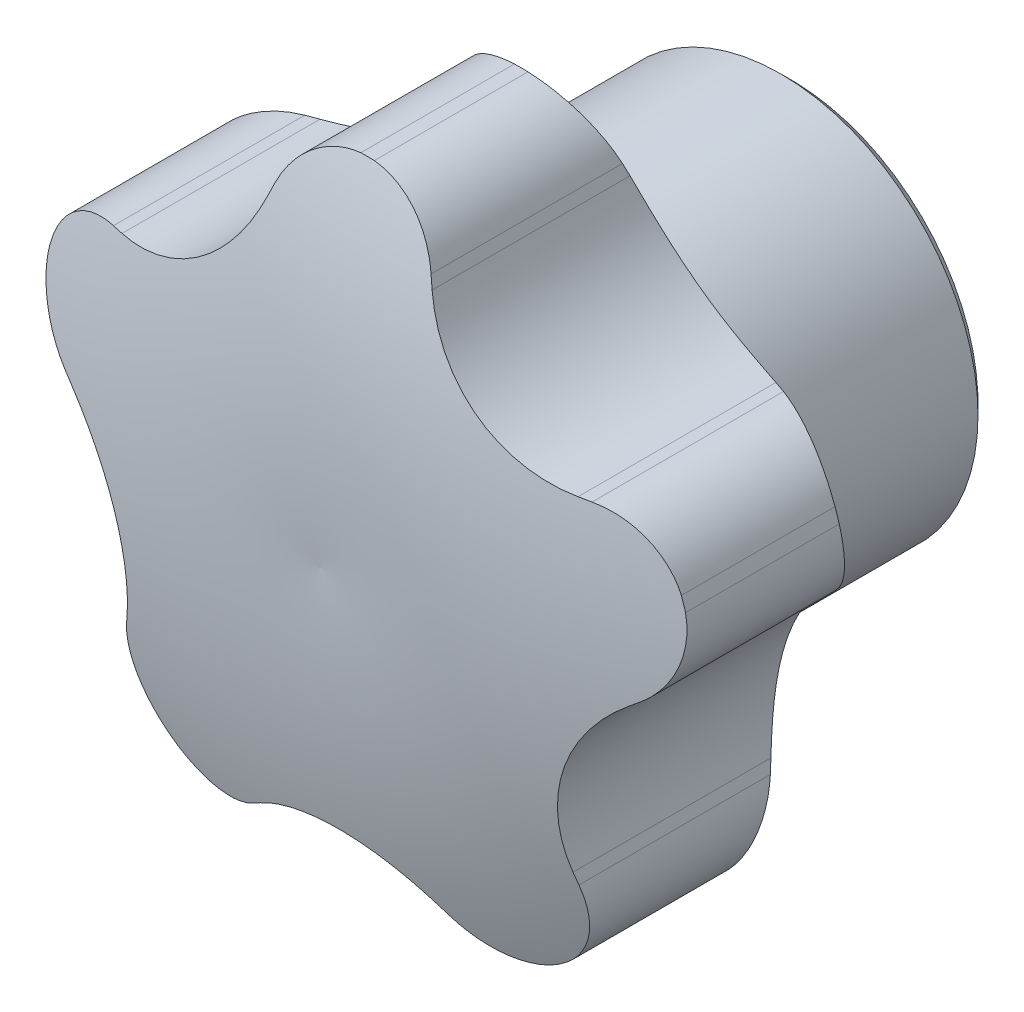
ISO-10303-21;
HEADER;
FILE_DESCRIPTION(('STEP AP214'),'2;1');
FILE_NAME('part.step','',(''),(''),'','','');
FILE_SCHEMA(('AUTOMOTIVE_DESIGN { 1 0 10303 214 1 1 1 1 }'));
ENDSEC;
DATA;
#1=APPLICATION_CONTEXT('core data for automotive mechanical design processes');
#2=APPLICATION_PROTOCOL_DEFINITION('international standard','automotive_design',2000,#1);
#3=PRODUCT_CONTEXT('',#1,'mechanical');
#4=PRODUCT('Part','Part','',(#3));
#5=PRODUCT_RELATED_PRODUCT_CATEGORY('part','',(#4));
#6=PRODUCT_DEFINITION_FORMATION('','',#4);
#7=PRODUCT_DEFINITION_CONTEXT('part definition',#1,'design');
#8=PRODUCT_DEFINITION('design','',#6,#7);
#9=PRODUCT_DEFINITION_SHAPE('','',#8);
#10=(LENGTH_UNIT() NAMED_UNIT(*) SI_UNIT(.MILLI.,.METRE.));
#11=(NAMED_UNIT(*) PLANE_ANGLE_UNIT() SI_UNIT($,.RADIAN.));
#12=(NAMED_UNIT(*) SI_UNIT($,.STERADIAN.) SOLID_ANGLE_UNIT());
#13=UNCERTAINTY_MEASURE_WITH_UNIT(LENGTH_MEASURE(1.E-05),#10,'distance_accuracy_value','');
#14=(GEOMETRIC_REPRESENTATION_CONTEXT(3) GLOBAL_UNCERTAINTY_ASSIGNED_CONTEXT((#13)) GLOBAL_UNIT_ASSIGNED_CONTEXT((#10,
#11,#12)) REPRESENTATION_CONTEXT('',''));
#15=CARTESIAN_POINT('',(0.,0.,0.));
#16=DIRECTION('',(0.,0.,1.));
#17=DIRECTION('',(1.,0.,0.));
#18=AXIS2_PLACEMENT_3D('',#15,#16,#17);
#19=CARTESIAN_POINT('',(0.,0.,-27.));
#20=DIRECTION('',(0.,0.,-1.));
#21=DIRECTION('',(-1.,0.,0.));
#22=AXIS2_PLACEMENT_3D('',#19,#20,#21);
#23=CYLINDRICAL_SURFACE('',#22,16.);
#24=CARTESIAN_POINT('',(0.,0.,20.7));
#25=DIRECTION('',(0.,0.,-1.));
#26=DIRECTION('',(-1.,0.,0.));
#27=AXIS2_PLACEMENT_3D('',#24,#25,#26);
#28=CIRCLE('',#27,16.);
#29=CARTESIAN_POINT('',(-15.3145548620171,4.63296982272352,20.7));
#30=VERTEX_POINT('',#29);
#31=CARTESIAN_POINT('',(-15.1129264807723,5.25351817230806,20.7));
#32=VERTEX_POINT('',#31);
#33=EDGE_CURVE('E312',#30,#32,#28,.T.);
#34=ORIENTED_EDGE('',*,*,#33,.T.);
#35=DIRECTION('',(0.,0.,1.));
#36=VECTOR('',#35,1.);
#37=CARTESIAN_POINT('',(-15.1129264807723,5.25351817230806,0.));
#38=LINE('',#37,#36);
#39=CARTESIAN_POINT('',(-15.1129264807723,5.25351817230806,13.2999999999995));
#40=VERTEX_POINT('',#39);
#41=EDGE_CURVE('E592',#32,#40,#38,.F.);
#42=ORIENTED_EDGE('',*,*,#41,.T.);
#43=CARTESIAN_POINT('',(0.,0.,13.3));
#44=DIRECTION('',(0.,0.,-1.));
#45=DIRECTION('',(-1.,0.,0.));
#46=AXIS2_PLACEMENT_3D('',#43,#44,#45);
#47=CIRCLE('',#46,16.);
#48=CARTESIAN_POINT('',(-15.3145548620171,4.63296982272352,13.2999999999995));
#49=VERTEX_POINT('',#48);
#50=EDGE_CURVE('E309',#49,#40,#47,.T.);
#51=ORIENTED_EDGE('',*,*,#50,.F.);
#52=DIRECTION('',(0.,0.,1.));
#53=VECTOR('',#52,1.);
#54=CARTESIAN_POINT('',(-15.3145548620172,4.63296982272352,0.));
#55=LINE('',#54,#53);
#56=EDGE_CURVE('E584',#49,#30,#55,.T.);
#57=ORIENTED_EDGE('',*,*,#56,.T.);
#58=EDGE_LOOP('',(#34,#42,#51,#57));
#59=FACE_BOUND('',#58,.T.);
#60=ADVANCED_FACE('F14',(#59),#23,.T.);
#61=CARTESIAN_POINT('',(-9.1386738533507,-13.1333407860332,20.7));
#62=VERTEX_POINT('',#61);
#63=CARTESIAN_POINT('',(-9.66654380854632,-12.7498208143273,20.7));
#64=VERTEX_POINT('',#63);
#65=EDGE_CURVE('E322',#62,#64,#28,.T.);
#66=ORIENTED_EDGE('',*,*,#65,.T.);
#67=DIRECTION('',(0.,0.,1.));
#68=VECTOR('',#67,1.);
#69=CARTESIAN_POINT('',(-9.6665438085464,-12.7498208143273,0.));
#70=LINE('',#69,#68);
#71=CARTESIAN_POINT('',(-9.66654380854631,-12.7498208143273,13.2999999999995));
#72=VERTEX_POINT('',#71);
#73=EDGE_CURVE('E510',#64,#72,#70,.F.);
#74=ORIENTED_EDGE('',*,*,#73,.T.);
#75=CARTESIAN_POINT('',(-9.13867385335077,-13.1333407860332,13.2999999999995));
#76=VERTEX_POINT('',#75);
#77=EDGE_CURVE('E811',#76,#72,#47,.T.);
#78=ORIENTED_EDGE('',*,*,#77,.F.);
#79=DIRECTION('',(0.,0.,1.));
#80=VECTOR('',#79,1.);
#81=CARTESIAN_POINT('',(-9.13867385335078,-13.1333407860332,0.));
#82=LINE('',#81,#80);
#83=EDGE_CURVE('E502',#76,#62,#82,.T.);
#84=ORIENTED_EDGE('',*,*,#83,.T.);
#85=EDGE_LOOP('',(#66,#74,#78,#84));
#86=FACE_BOUND('',#85,.T.);
#87=ADVANCED_FACE('F836',(#86),#23,.T.);
#88=CARTESIAN_POINT('',(9.6665438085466,-12.7498208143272,20.7));
#89=VERTEX_POINT('',#88);
#90=CARTESIAN_POINT('',(9.13867385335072,-13.1333407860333,20.7));
#91=VERTEX_POINT('',#90);
#92=EDGE_CURVE('E320',#89,#91,#28,.T.);
#93=ORIENTED_EDGE('',*,*,#92,.T.);
#94=DIRECTION('',(0.,0.,1.));
#95=VECTOR('',#94,1.);
#96=CARTESIAN_POINT('',(9.13867385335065,-13.1333407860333,0.));
#97=LINE('',#96,#95);
#98=CARTESIAN_POINT('',(9.1386738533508,-13.1333407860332,13.2999999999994));
#99=VERTEX_POINT('',#98);
#100=EDGE_CURVE('E339',#91,#99,#97,.F.);
#101=ORIENTED_EDGE('',*,*,#100,.T.);
#102=CARTESIAN_POINT('',(9.66654380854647,-12.7498208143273,13.2999999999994));
#103=VERTEX_POINT('',#102);
#104=EDGE_CURVE('E813',#103,#99,#47,.T.);
#105=ORIENTED_EDGE('',*,*,#104,.F.);
#106=DIRECTION('',(0.,0.,1.));
#107=VECTOR('',#106,1.);
#108=CARTESIAN_POINT('',(9.66654380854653,-12.7498208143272,0.));
#109=LINE('',#108,#107);
#110=EDGE_CURVE('E341',#103,#89,#109,.T.);
#111=ORIENTED_EDGE('',*,*,#110,.T.);
#112=EDGE_LOOP('',(#93,#101,#105,#111));
#113=FACE_BOUND('',#112,.T.);
#114=ADVANCED_FACE('F337',(#113),#23,.T.);
#115=CARTESIAN_POINT('',(-0.326241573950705,15.9966736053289,20.7));
#116=VERTEX_POINT('',#115);
#117=CARTESIAN_POINT('',(0.326241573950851,15.9966736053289,20.7));
#118=VERTEX_POINT('',#117);
#119=EDGE_CURVE('E232',#116,#118,#28,.T.);
#120=ORIENTED_EDGE('',*,*,#119,.T.);
#121=DIRECTION('',(0.,0.,1.));
#122=VECTOR('',#121,1.);
#123=CARTESIAN_POINT('',(0.326241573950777,15.9966736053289,0.));
#124=LINE('',#123,#122);
#125=CARTESIAN_POINT('',(0.326241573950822,15.9966736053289,13.2999999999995));
#126=VERTEX_POINT('',#125);
#127=EDGE_CURVE('E671',#118,#126,#124,.F.);
#128=ORIENTED_EDGE('',*,*,#127,.T.);
#129=CARTESIAN_POINT('',(-0.326241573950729,15.9966736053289,13.2999999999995));
#130=VERTEX_POINT('',#129);
#131=EDGE_CURVE('E310',#130,#126,#47,.T.);
#132=ORIENTED_EDGE('',*,*,#131,.F.);
#133=DIRECTION('',(0.,0.,1.));
#134=VECTOR('',#133,1.);
#135=CARTESIAN_POINT('',(-0.326241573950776,15.9966736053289,0.));
#136=LINE('',#135,#134);
#137=EDGE_CURVE('E662',#130,#116,#136,.T.);
#138=ORIENTED_EDGE('',*,*,#137,.T.);
#139=EDGE_LOOP('',(#120,#128,#132,#138));
#140=FACE_BOUND('',#139,.T.);
#141=ADVANCED_FACE('F791',(#140),#23,.T.);
#142=CARTESIAN_POINT('',(-2.59665404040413,0.,-15.7384936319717));
#143=DIRECTION('',(0.,-1.,0.));
#144=DIRECTION('',(-1.,0.,0.));
#145=AXIS2_PLACEMENT_3D('',#142,#143,#144);
#146=CIRCLE('',#145,38.8254233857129);
#147=TRIMMED_CURVE('',#146,(PARAMETER_VALUE(-1.63772653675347)),
(PARAMETER_VALUE(1.63772653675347)),.T.,.PARAMETER.);
#148=CARTESIAN_POINT('',(0.,0.,-15.7384936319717));
#149=DIRECTION('',(0.,0.,-1.));
#150=AXIS1_PLACEMENT('',#148,#149);
#151=SURFACE_OF_REVOLUTION('',#147,#150);
#152=CARTESIAN_POINT('',(0.,0.,23.));
#153=VERTEX_POINT('',#152);
#154=VERTEX_LOOP('',#153);
#155=FACE_BOUND('',#154,.T.);
#156=CARTESIAN_POINT('',(-3.77099647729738,13.3440110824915,21.415260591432));
#157=CARTESIAN_POINT('',(-3.73320410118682,13.4508726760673,21.3871864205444));
#158=CARTESIAN_POINT('',(-3.69082482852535,13.5561957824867,21.3594189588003));
#159=CARTESIAN_POINT('',(-3.59717795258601,13.7630488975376,21.3047121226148));
#160=CARTESIAN_POINT('',(-3.54590951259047,13.8645785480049,21.277772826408));
#161=CARTESIAN_POINT('',(-3.43474465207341,14.0631659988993,21.2249269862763));
#162=CARTESIAN_POINT('',(-3.37484322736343,14.1602211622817,21.1990210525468));
#163=CARTESIAN_POINT('',(-3.24680122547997,14.3490799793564,21.1484760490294));
#164=CARTESIAN_POINT('',(-3.17866104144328,14.4408838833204,21.1238369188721));
#165=CARTESIAN_POINT('',(-3.03449158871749,14.6186333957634,21.0760148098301));
#166=CARTESIAN_POINT('',(-2.95845492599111,14.7045733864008,21.0528332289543));
#167=CARTESIAN_POINT('',(-2.79900496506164,14.869853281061,21.0081525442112));
#168=CARTESIAN_POINT('',(-2.71558910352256,14.9491908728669,20.9866540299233));
#169=CARTESIAN_POINT('',(-2.54199733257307,15.1005508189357,20.9455591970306));
#170=CARTESIAN_POINT('',(-2.45182452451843,15.1725764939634,20.9259620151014));
#171=CARTESIAN_POINT('',(-2.26530938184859,15.3087428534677,20.8888498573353));
#172=CARTESIAN_POINT('',(-2.16896729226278,15.3728838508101,20.8713347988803));
#173=CARTESIAN_POINT('',(-1.97314202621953,15.4913062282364,20.8389499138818));
#174=CARTESIAN_POINT('',(-1.87378667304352,15.5457846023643,20.8240274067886));
#175=CARTESIAN_POINT('',(-1.6705909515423,15.6462016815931,20.7964888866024));
#176=CARTESIAN_POINT('',(-1.56675241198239,15.6921438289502,20.7838719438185));
#177=CARTESIAN_POINT('',(-1.35541384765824,15.7750666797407,20.7610775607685));
#178=CARTESIAN_POINT('',(-1.24791739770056,15.8120558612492,20.7508978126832));
#179=CARTESIAN_POINT('',(-1.03001609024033,15.8767784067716,20.7330730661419));
#180=CARTESIAN_POINT('',(-0.919612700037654,15.9045163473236,20.7254268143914));
#181=CARTESIAN_POINT('',(-0.72716441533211,15.9442185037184,20.7144774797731));
#182=CARTESIAN_POINT('',(-0.645608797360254,15.9584217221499,20.7105585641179));
#183=CARTESIAN_POINT('',(-0.481866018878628,15.9817298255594,20.7041258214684));
#184=CARTESIAN_POINT('',(-0.399680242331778,15.9908437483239,20.7016095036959));
#185=CARTESIAN_POINT('',(-0.317265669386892,15.9973979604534,20.6998));
#186=B_SPLINE_CURVE_WITH_KNOTS('',3,(#156,#157,#158,#159,#160,#161,#162,#163,#164,#165,#166,
#167,#168,#169,#170,#171,#172,#173,#174,#175,#176,#177,#178,#179,#180,#181,#182,#183,#184,#185),
.UNSPECIFIED.,.F.,.F.,(4,2,2,2,2,2,2,2,2,2,2,2,2,2,4),(0.,0.350222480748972,0.700477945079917,
1.05093726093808,1.40137986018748,1.75215361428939,2.10304969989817,2.45378570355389,
2.80450778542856,3.14695123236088,3.48925628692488,3.83123591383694,4.17304611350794,
4.42151117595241,4.66953358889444),.UNSPECIFIED.);
#187=CARTESIAN_POINT('',(-3.77092572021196,13.3442110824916,21.4152080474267));
#188=VERTEX_POINT('',#187);
#189=EDGE_CURVE('E664',#188,#116,#186,.T.);
#190=ORIENTED_EDGE('',*,*,#189,.F.);
#191=CARTESIAN_POINT('',(-3.95260918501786,12.8307129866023,21.5461485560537));
#192=CARTESIAN_POINT('',(-3.92226680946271,12.9164706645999,21.5249399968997));
#193=CARTESIAN_POINT('',(-3.89194943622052,13.0021576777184,21.5034196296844));
#194=CARTESIAN_POINT('',(-3.83136469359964,13.1733903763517,21.4597552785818));
#195=CARTESIAN_POINT('',(-3.8010973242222,13.258936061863,21.4376112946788));
#196=CARTESIAN_POINT('',(-3.77085495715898,13.3444110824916,21.415155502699));
#197=B_SPLINE_CURVE_WITH_KNOTS('',3,(#191,#192,#193,#194,#195,#196),.UNSPECIFIED.,.F.,.F.,(4,2,
4),(0.,0.280215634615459,0.560431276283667),.UNSPECIFIED.);
#198=CARTESIAN_POINT('',(-3.9525384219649,12.8309129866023,21.5460990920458));
#199=VERTEX_POINT('',#198);
#200=EDGE_CURVE('E651',#199,#188,#197,.T.);
#201=ORIENTED_EDGE('',*,*,#200,.F.);
#202=CARTESIAN_POINT('',(-3.95246766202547,12.8311129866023,21.5460496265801));
#203=CARTESIAN_POINT('',(-4.01935057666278,12.6419853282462,21.5928356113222));
#204=CARTESIAN_POINT('',(-4.093930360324,12.454862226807,21.6367985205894));
#205=CARTESIAN_POINT('',(-4.25814425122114,12.0859801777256,21.7188765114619));
#206=CARTESIAN_POINT('',(-4.34778093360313,11.9042221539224,21.7569905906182));
#207=CARTESIAN_POINT('',(-4.54179627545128,11.5473986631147,21.8271712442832));
#208=CARTESIAN_POINT('',(-4.64618254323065,11.3723367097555,21.859234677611));
#209=CARTESIAN_POINT('',(-4.86909539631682,11.030392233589,21.9171386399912));
#210=CARTESIAN_POINT('',(-4.9876208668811,10.8635090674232,21.9429796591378));
#211=CARTESIAN_POINT('',(-5.23830361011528,10.5389870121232,21.988369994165));
#212=CARTESIAN_POINT('',(-5.3704814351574,10.3813626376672,22.0079096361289));
#213=CARTESIAN_POINT('',(-5.64745186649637,10.0768963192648,22.0405756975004));
#214=CARTESIAN_POINT('',(-5.79224454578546,9.93005443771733,22.0537020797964));
#215=CARTESIAN_POINT('',(-6.09330700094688,9.64843857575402,22.0734952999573));
#216=CARTESIAN_POINT('',(-6.24956704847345,9.5136545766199,22.0801675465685));
#217=CARTESIAN_POINT('',(-6.57253039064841,9.25706710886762,22.0870549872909));
#218=CARTESIAN_POINT('',(-6.7392333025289,9.13526316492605,22.0872704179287));
#219=CARTESIAN_POINT('',(-7.07799217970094,8.90812281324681,22.0813121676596));
#220=CARTESIAN_POINT('',(-7.2498442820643,8.80247838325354,22.0752816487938));
#221=CARTESIAN_POINT('',(-7.60108680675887,8.60518068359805,22.0570643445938));
#222=CARTESIAN_POINT('',(-7.78047715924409,8.51352728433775,22.0448776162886));
#223=CARTESIAN_POINT('',(-8.14556763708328,8.34474401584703,22.0143736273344));
#224=CARTESIAN_POINT('',(-8.33127092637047,8.26762155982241,21.9960532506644));
#225=CARTESIAN_POINT('',(-8.70752265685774,8.1283893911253,21.953343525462));
#226=CARTESIAN_POINT('',(-8.8980704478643,8.06627767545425,21.9289549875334));
#227=CARTESIAN_POINT('',(-9.2455117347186,7.96784147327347,21.8794896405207));
#228=CARTESIAN_POINT('',(-9.40180657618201,7.92885382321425,21.8554531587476));
#229=CARTESIAN_POINT('',(-9.71593106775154,7.86088893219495,21.8035583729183));
#230=CARTESIAN_POINT('',(-9.87376067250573,7.83191139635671,21.7757001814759));
#231=CARTESIAN_POINT('',(-10.1899340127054,7.78402260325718,21.7163039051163));
#232=CARTESIAN_POINT('',(-10.3482762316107,7.76509259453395,21.6847728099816));
#233=CARTESIAN_POINT('',(-10.6650823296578,7.7371501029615,21.6180962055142));
#234=CARTESIAN_POINT('',(-10.8235462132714,7.72813800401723,21.5829505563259));
#235=CARTESIAN_POINT('',(-10.981721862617,7.72405240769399,21.5460524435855));
#236=B_SPLINE_CURVE_WITH_KNOTS('',3,(#202,#203,#204,#205,#206,#207,#208,#209,#210,#211,#212,
#213,#214,#215,#216,#217,#218,#219,#220,#221,#222,#223,#224,#225,#226,#227,#228,#229,#230,#231,
#232,#233,#234,#235),.UNSPECIFIED.,.F.,.F.,(4,2,2,2,2,2,2,2,2,2,2,2,2,2,2,2,4),(0.,
0.617822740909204,1.23575125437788,1.85399968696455,2.47219940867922,3.0913437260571,
3.71049162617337,4.32912021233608,4.94772613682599,5.55246035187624,6.15718896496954,
6.76222526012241,7.36718077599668,7.85543723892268,8.34367931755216,8.83100696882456,
9.31835348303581),.UNSPECIFIED.);
#237=CARTESIAN_POINT('',(-10.981521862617,7.72405758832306,21.5460990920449));
#238=VERTEX_POINT('',#237);
#239=EDGE_CURVE('E643',#199,#238,#236,.T.);
#240=ORIENTED_EDGE('',*,*,#239,.T.);
#241=CARTESIAN_POINT('',(-11.5260187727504,7.70994629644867,21.4151584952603));
#242=CARTESIAN_POINT('',(-11.4353858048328,7.71229515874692,21.4376132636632));
#243=CARTESIAN_POINT('',(-11.3446779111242,7.71464596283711,21.4597562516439));
#244=CARTESIAN_POINT('',(-11.1631122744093,7.71935145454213,21.5034186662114));
#245=CARTESIAN_POINT('',(-11.0722545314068,7.72170614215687,21.5249380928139));
#246=CARTESIAN_POINT('',(-10.981321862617,7.72406277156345,21.54614573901));
#247=B_SPLINE_CURVE_WITH_KNOTS('',3,(#241,#242,#243,#244,#245,#246),.UNSPECIFIED.,.F.,.F.,(4,2,
4),(0.,0.280203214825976,0.560406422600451),.UNSPECIFIED.);
#248=CARTESIAN_POINT('',(-11.5258187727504,7.70995147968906,21.4152080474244));
#249=VERTEX_POINT('',#248);
#250=EDGE_CURVE('E652',#249,#238,#247,.T.);
#251=ORIENTED_EDGE('',*,*,#250,.F.);
#252=CARTESIAN_POINT('',(-15.1163890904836,5.24520541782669,20.6998));
#253=CARTESIAN_POINT('',(-15.0741587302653,5.34694466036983,20.7022082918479));
#254=CARTESIAN_POINT('',(-15.0277158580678,5.44689641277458,20.7058758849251));
#255=CARTESIAN_POINT('',(-14.9268181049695,5.64252631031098,20.7156733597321));
#256=CARTESIAN_POINT('',(-14.8723644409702,5.73820510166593,20.7218028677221));
#257=CARTESIAN_POINT('',(-14.7559576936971,5.92444153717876,20.7364544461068));
#258=CARTESIAN_POINT('',(-14.6940193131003,6.0150087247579,20.7449718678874));
#259=CARTESIAN_POINT('',(-14.5630725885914,6.19058003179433,20.7643130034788));
#260=CARTESIAN_POINT('',(-14.4940641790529,6.27558409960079,20.7751367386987));
#261=CARTESIAN_POINT('',(-14.2772082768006,6.52136213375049,20.8109202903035));
#262=CARTESIAN_POINT('',(-14.1194134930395,6.67308773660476,20.839207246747));
#263=CARTESIAN_POINT('',(-13.7822732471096,6.94817964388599,20.9035773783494));
#264=CARTESIAN_POINT('',(-13.6029206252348,7.07153648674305,20.9396631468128));
#265=CARTESIAN_POINT('',(-13.2240833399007,7.28925783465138,21.0191498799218));
#266=CARTESIAN_POINT('',(-13.0242746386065,7.38301095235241,21.0626796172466));
#267=CARTESIAN_POINT('',(-12.6131370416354,7.53617382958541,21.1550869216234));
#268=CARTESIAN_POINT('',(-12.4018144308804,7.5956021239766,21.2039615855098));
#269=CARTESIAN_POINT('',(-12.0782654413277,7.65870241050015,21.280639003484));
#270=CARTESIAN_POINT('',(-11.968101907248,7.67542891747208,21.3070616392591));
#271=CARTESIAN_POINT('',(-11.747194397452,7.69961177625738,21.3606418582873));
#272=CARTESIAN_POINT('',(-11.6364521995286,7.70708816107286,21.3877977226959));
#273=CARTESIAN_POINT('',(-11.5256187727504,7.70995665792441,21.4152575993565));
#274=B_SPLINE_CURVE_WITH_KNOTS('',3,(#252,#253,#254,#255,#256,#257,#258,#259,#260,#261,#262,
#263,#264,#265,#266,#267,#268,#269,#270,#271,#272,#273),.UNSPECIFIED.,.F.,.F.,(4,2,2,2,2,2,2,2,
2,2,4),(0.,0.330431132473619,0.660812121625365,0.990554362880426,1.32029966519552,
1.97913896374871,2.63819768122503,3.31009108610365,3.98162133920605,4.32484055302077,
4.66731514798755),.UNSPECIFIED.);
#275=EDGE_CURVE('E803',#32,#249,#274,.T.);
#276=ORIENTED_EDGE('',*,*,#275,.F.);
#277=ORIENTED_EDGE('',*,*,#33,.F.);
#278=CARTESIAN_POINT('',(-13.8561182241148,0.537024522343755,21.4152894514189));
#279=CARTESIAN_POINT('',(-13.9460733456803,0.605986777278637,21.387215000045));
#280=CARTESIAN_POINT('',(-14.0331479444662,0.678836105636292,21.3594472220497));
#281=CARTESIAN_POINT('',(-14.2009432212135,0.831816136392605,21.3047396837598));
#282=CARTESIAN_POINT('',(-14.2816633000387,0.911947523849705,21.277800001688));
#283=CARTESIAN_POINT('',(-14.4361844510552,1.07903433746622,21.2249533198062));
#284=CARTESIAN_POINT('',(-14.5099814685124,1.16599370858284,21.1990469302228));
#285=CARTESIAN_POINT('',(-14.6500351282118,1.34612577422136,21.1485009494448));
#286=CARTESIAN_POINT('',(-14.716292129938,1.43929817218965,21.123861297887));
#287=CARTESIAN_POINT('',(-14.8407968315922,1.63133585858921,21.0760380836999));
#288=CARTESIAN_POINT('',(-14.8990369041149,1.73020644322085,21.0528559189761));
#289=CARTESIAN_POINT('',(-15.0069606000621,1.93292392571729,21.008174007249));
#290=CARTESIAN_POINT('',(-15.0566412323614,2.03677254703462,20.9866748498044));
#291=CARTESIAN_POINT('',(-15.1469564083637,2.24863870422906,20.9455786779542));
#292=CARTESIAN_POINT('',(-15.187595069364,2.35665431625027,20.9259808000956));
#293=CARTESIAN_POINT('',(-15.2594669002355,2.57611679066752,20.8888672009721));
#294=CARTESIAN_POINT('',(-15.2907004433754,2.6875635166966,20.8713513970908));
#295=CARTESIAN_POINT('',(-15.3428198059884,2.9103978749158,20.8389649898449));
#296=CARTESIAN_POINT('',(-15.3639324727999,3.02172480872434,20.8240417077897));
#297=CARTESIAN_POINT('',(-15.3966501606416,3.24600555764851,20.7965016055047));
#298=CARTESIAN_POINT('',(-15.4082590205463,3.35895869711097,20.7838838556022));
#299=CARTESIAN_POINT('',(-15.4218224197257,3.58557832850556,20.7610878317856));
#300=CARTESIAN_POINT('',(-15.4237861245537,3.69924404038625,20.750907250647));
#301=CARTESIAN_POINT('',(-15.4180119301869,3.92648160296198,20.733080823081));
#302=CARTESIAN_POINT('',(-15.4102788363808,4.04005347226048,20.7254337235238));
#303=CARTESIAN_POINT('',(-15.3885713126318,4.23537020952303,20.7144819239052));
#304=CARTESIAN_POINT('',(-15.3768764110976,4.31734145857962,20.7105616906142));
#305=CARTESIAN_POINT('',(-15.3484404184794,4.48030878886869,20.7041269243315));
#306=CARTESIAN_POINT('',(-15.33170835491,4.56130634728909,20.7016098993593));
#307=CARTESIAN_POINT('',(-15.3124700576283,4.64173025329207,20.6998));
#308=B_SPLINE_CURVE_WITH_KNOTS('',3,(#278,#279,#280,#281,#282,#283,#284,#285,#286,#287,#288,
#289,#290,#291,#292,#293,#294,#295,#296,#297,#298,#299,#300,#301,#302,#303,#304,#305,#306,#307),
.UNSPECIFIED.,.F.,.F.,(4,2,2,2,2,2,2,2,2,2,2,2,2,2,4),(0.,0.350223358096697,0.700479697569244,
1.05093991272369,1.40138341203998,1.75215805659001,2.10305503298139,2.45379189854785,
2.80451484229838,3.14695926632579,3.48926529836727,3.83124598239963,4.17305725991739,
4.42157679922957,4.66965357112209),.UNSPECIFIED.);
#309=CARTESIAN_POINT('',(-13.8563790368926,0.537224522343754,21.4152080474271));
#310=VERTEX_POINT('',#309);
#311=EDGE_CURVE('E586',#310,#30,#308,.T.);
#312=ORIENTED_EDGE('',*,*,#311,.F.);
#313=CARTESIAN_POINT('',(-13.4241249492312,0.205729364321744,21.5461578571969));
#314=CARTESIAN_POINT('',(-13.4963196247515,0.261095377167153,21.5249462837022));
#315=CARTESIAN_POINT('',(-13.5684548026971,0.316415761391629,21.5034228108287));
#316=CARTESIAN_POINT('',(-13.7126061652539,0.426965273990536,21.459752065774));
#317=CARTESIAN_POINT('',(-13.7846223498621,0.48219440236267,21.4376047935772));
#318=CARTESIAN_POINT('',(-13.8565790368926,0.537377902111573,21.4151456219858));
#319=B_SPLINE_CURVE_WITH_KNOTS('',3,(#313,#314,#315,#316,#317,#318),.UNSPECIFIED.,.F.,.F.,(4,2,
4),(0.,0.280256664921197,0.560513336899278),.UNSPECIFIED.);
#320=CARTESIAN_POINT('',(-13.4243249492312,0.205882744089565,21.5460990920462));
#321=VERTEX_POINT('',#320);
#322=EDGE_CURVE('E573',#321,#310,#319,.T.);
#323=ORIENTED_EDGE('',*,*,#322,.F.);
#324=CARTESIAN_POINT('',(-13.4245249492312,0.206036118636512,21.546040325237));
#325=CARTESIAN_POINT('',(-13.265321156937,0.0839838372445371,21.5928267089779));
#326=CARTESIAN_POINT('',(-13.1104022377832,-0.0447691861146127,21.6367900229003));
#327=CARTESIAN_POINT('',(-12.8103179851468,-0.314935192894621,21.7188688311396));
#328=CARTESIAN_POINT('',(-12.66515432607,-0.456350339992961,21.7569833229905));
#329=CARTESIAN_POINT('',(-12.3857474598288,-0.751133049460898,21.8271648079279));
#330=CARTESIAN_POINT('',(-12.2515099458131,-0.904506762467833,21.8592286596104));
#331=CARTESIAN_POINT('',(-11.9951835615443,-1.22217492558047,21.9171334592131));
#332=CARTESIAN_POINT('',(-11.8730937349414,-1.38646851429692,21.9429748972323));
#333=CARTESIAN_POINT('',(-11.6419183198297,-1.72516375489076,21.9883660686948));
#334=CARTESIAN_POINT('',(-11.5328528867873,-1.89958046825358,22.0079061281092));
#335=CARTESIAN_POINT('',(-11.3288748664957,-2.2570794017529,22.0405730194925));
#336=CARTESIAN_POINT('',(-11.2339623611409,-2.44016167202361,22.0536998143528));
#337=CARTESIAN_POINT('',(-11.0591612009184,-2.81351248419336,22.0734938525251));
#338=CARTESIAN_POINT('',(-10.9792600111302,-3.00377486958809,22.0801665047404));
#339=CARTESIAN_POINT('',(-10.8350299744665,-3.3902206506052,22.0870547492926));
#340=CARTESIAN_POINT('',(-10.7707005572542,-3.58640382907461,22.0872705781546));
#341=CARTESIAN_POINT('',(-10.6593575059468,-3.97877251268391,22.0813131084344));
#342=CARTESIAN_POINT('',(-10.611987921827,-4.17485931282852,22.0752829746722));
#343=CARTESIAN_POINT('',(-10.5328845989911,-4.56987886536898,22.0570664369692));
#344=CARTESIAN_POINT('',(-10.501150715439,-4.768811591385,22.0448800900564));
#345=CARTESIAN_POINT('',(-10.453445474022,-5.16819007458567,22.0143768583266));
#346=CARTESIAN_POINT('',(-10.4374821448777,-5.36863655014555,21.9960568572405));
#347=CARTESIAN_POINT('',(-10.4213307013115,-5.76949841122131,21.9533478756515));
#348=CARTESIAN_POINT('',(-10.4211404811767,-5.96991379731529,21.9289597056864));
#349=CARTESIAN_POINT('',(-10.4348857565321,-6.33077257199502,21.8794944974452));
#350=CARTESIAN_POINT('',(-10.4461036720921,-6.49146953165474,21.8554576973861));
#351=CARTESIAN_POINT('',(-10.4785347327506,-6.81122971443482,21.8035620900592));
#352=CARTESIAN_POINT('',(-10.4997475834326,-6.97029298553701,21.7757033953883));
#353=CARTESIAN_POINT('',(-10.5519062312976,-7.28579775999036,21.7163059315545));
#354=CARTESIAN_POINT('',(-10.5828337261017,-7.44224361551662,21.6847741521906));
#355=CARTESIAN_POINT('',(-10.6541588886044,-7.75218620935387,21.618096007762));
#356=CARTESIAN_POINT('',(-10.6945569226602,-7.90568283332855,21.5829495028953));
#357=CARTESIAN_POINT('',(-10.7395514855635,-8.05738286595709,21.5460504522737));
#358=B_SPLINE_CURVE_WITH_KNOTS('',3,(#324,#325,#326,#327,#328,#329,#330,#331,#332,#333,#334,
#335,#336,#337,#338,#339,#340,#341,#342,#343,#344,#345,#346,#347,#348,#349,#350,#351,#352,#353,
#354,#355,#356,#357),.UNSPECIFIED.,.F.,.F.,(4,2,2,2,2,2,2,2,2,2,2,2,2,2,2,2,4),(0.,
0.617823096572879,1.23575196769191,1.85400078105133,2.47220088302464,3.09134559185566,
3.71049388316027,4.32912284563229,4.94772914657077,5.55246347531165,6.15719220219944,
6.76222863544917,7.36718429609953,7.85545229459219,8.34370591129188,8.83104512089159,
9.31840318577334),.UNSPECIFIED.);
#359=CARTESIAN_POINT('',(-10.7394921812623,-8.05718286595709,21.5460990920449));
#360=VERTEX_POINT('',#359);
#361=EDGE_CURVE('E565',#321,#360,#358,.T.);
#362=ORIENTED_EDGE('',*,*,#361,.T.);
#363=CARTESIAN_POINT('',(-10.8943327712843,-8.57939901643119,21.4151563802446));
#364=CARTESIAN_POINT('',(-10.8685587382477,-8.4924733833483,21.4376118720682));
#365=CARTESIAN_POINT('',(-10.8427633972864,-8.40547588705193,21.4597555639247));
#366=CARTESIAN_POINT('',(-10.7911301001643,-8.23133717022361,21.5034193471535));
#367=CARTESIAN_POINT('',(-10.7652921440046,-8.14419594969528,21.5249394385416));
#368=CARTESIAN_POINT('',(-10.7394328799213,-8.05698286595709,21.5461477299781));
#369=B_SPLINE_CURVE_WITH_KNOTS('',3,(#363,#364,#365,#366,#367,#368),.UNSPECIFIED.,.F.,.F.,(4,2,
4),(0.,0.280211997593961,0.56042398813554),.UNSPECIFIED.);
#370=CARTESIAN_POINT('',(-10.8942734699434,-8.57919901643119,21.4152080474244));
#371=VERTEX_POINT('',#370);
#372=EDGE_CURVE('E574',#371,#360,#369,.T.);
#373=ORIENTED_EDGE('',*,*,#372,.F.);
#374=CARTESIAN_POINT('',(-9.6597079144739,-12.7556827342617,20.6998));
#375=CARTESIAN_POINT('',(-9.74341778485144,-12.6840801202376,20.7022082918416));
#376=CARTESIAN_POINT('',(-9.82412591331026,-12.6090235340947,20.7058758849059));
#377=CARTESIAN_POINT('',(-9.97900188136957,-12.4526111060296,20.715673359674));
#378=CARTESIAN_POINT('',(-10.0531707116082,-12.3712562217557,20.7218028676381));
#379=CARTESIAN_POINT('',(-10.19432042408,-12.2029966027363,20.7364544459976));
#380=CARTESIAN_POINT('',(-10.2613149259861,-12.1161029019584,20.7449718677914));
#381=CARTESIAN_POINT('',(-10.38782839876,-11.9373106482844,20.7643130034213));
#382=CARTESIAN_POINT('',(-10.4473473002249,-11.8454120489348,20.7751367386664));
#383=CARTESIAN_POINT('',(-10.6140839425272,-11.5632202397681,20.8109202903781));
#384=CARTESIAN_POINT('',(-10.7096222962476,-11.3662626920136,20.8392072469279));
#385=CARTESIAN_POINT('',(-10.8670681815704,-10.9606151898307,20.9035773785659));
#386=CARTESIAN_POINT('',(-10.9289645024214,-10.7519213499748,20.9396631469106));
#387=CARTESIAN_POINT('',(-11.018962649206,-10.3243460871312,21.0191498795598));
#388=CARTESIAN_POINT('',(-11.0463828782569,-10.1053454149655,21.0626796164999));
#389=CARTESIAN_POINT('',(-11.0650009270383,-9.66700039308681,21.1550869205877));
#390=CARTESIAN_POINT('',(-11.0562183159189,-9.44765629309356,21.2039615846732));
#391=CARTESIAN_POINT('',(-11.0162479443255,-9.12044243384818,21.2806393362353));
#392=CARTESIAN_POINT('',(-10.9981131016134,-9.01050051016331,21.3070623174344));
#393=CARTESIAN_POINT('',(-10.9528473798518,-8.79292933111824,21.3606432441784));
#394=CARTESIAN_POINT('',(-10.9257361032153,-8.68529557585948,21.3877994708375));
#395=CARTESIAN_POINT('',(-10.8942141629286,-8.57899901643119,21.4152597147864));
#396=B_SPLINE_CURVE_WITH_KNOTS('',3,(#374,#375,#376,#377,#378,#379,#380,#381,#382,#383,#384,
#385,#386,#387,#388,#389,#390,#391,#392,#393,#394,#395),.UNSPECIFIED.,.F.,.F.,(4,2,2,2,2,2,2,2,
2,2,4),(0.,0.33043113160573,0.660812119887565,0.990554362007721,1.32029966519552,
1.97913896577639,2.63819768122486,3.31009107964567,3.98162133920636,4.32484495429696,
4.66732393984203),.UNSPECIFIED.);
#397=EDGE_CURVE('E1066',#64,#371,#396,.T.);
#398=ORIENTED_EDGE('',*,*,#397,.F.);
#399=ORIENTED_EDGE('',*,*,#65,.F.);
#400=CARTESIAN_POINT('',(-4.79258748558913,-13.0120505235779,21.4152681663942));
#401=CARTESIAN_POINT('',(-4.88597338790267,-13.0762903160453,21.3871939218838));
#402=CARTESIAN_POINT('',(-4.98216589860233,-13.1365893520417,21.3594263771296));
#403=CARTESIAN_POINT('',(-5.17951226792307,-13.2488943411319,21.3047193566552));
#404=CARTESIAN_POINT('',(-5.28066659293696,-13.3008995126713,21.2777799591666));
#405=CARTESIAN_POINT('',(-5.48732700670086,-13.3962206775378,21.2249338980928));
#406=CARTESIAN_POINT('',(-5.59283559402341,-13.4395315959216,21.1990278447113));
#407=CARTESIAN_POINT('',(-5.80743169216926,-13.517062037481,21.1484825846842));
#408=CARTESIAN_POINT('',(-5.9165190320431,-13.5512819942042,21.1238433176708));
#409=CARTESIAN_POINT('',(-6.13763276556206,-13.610345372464,21.0760209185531));
#410=CARTESIAN_POINT('',(-6.24966183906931,-13.6351799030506,21.0528391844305));
#411=CARTESIAN_POINT('',(-6.47580844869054,-13.6751735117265,21.0081581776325));
#412=CARTESIAN_POINT('',(-6.58992669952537,-13.6903292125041,20.986659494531));
#413=CARTESIAN_POINT('',(-6.81933247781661,-13.710749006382,20.9455643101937));
#414=CARTESIAN_POINT('',(-6.93461944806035,-13.7160176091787,20.9259669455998));
#415=CARTESIAN_POINT('',(-7.16555003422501,-13.7165493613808,20.8888544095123));
#416=CARTESIAN_POINT('',(-7.28119363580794,-13.7118129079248,20.8713391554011));
#417=CARTESIAN_POINT('',(-7.50922677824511,-13.6925170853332,20.8389538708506));
#418=CARTESIAN_POINT('',(-7.62162869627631,-13.6781922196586,20.8240311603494));
#419=CARTESIAN_POINT('',(-7.84504156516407,-13.6399975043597,20.7964922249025));
#420=CARTESIAN_POINT('',(-7.95605305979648,-13.6161315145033,20.7838750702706));
#421=CARTESIAN_POINT('',(-8.17577092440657,-13.5589973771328,20.7610802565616));
#422=CARTESIAN_POINT('',(-8.28447938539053,-13.5257381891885,20.7509002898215));
#423=CARTESIAN_POINT('',(-8.49880889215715,-13.4500221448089,20.7330751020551));
#424=CARTESIAN_POINT('',(-8.60443144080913,-13.4075698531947,20.7254286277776));
#425=CARTESIAN_POINT('',(-8.78346669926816,-13.3265705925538,20.7144786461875));
#426=CARTESIAN_POINT('',(-8.85779949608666,-13.2901223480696,20.7105593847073));
#427=CARTESIAN_POINT('',(-9.00397903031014,-13.2127294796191,20.704126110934));
#428=CARTESIAN_POINT('',(-9.07582996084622,-13.1717929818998,20.7016096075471));
#429=CARTESIAN_POINT('',(-9.14636127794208,-13.1286508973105,20.6998));
#430=B_SPLINE_CURVE_WITH_KNOTS('',3,(#400,#401,#402,#403,#404,#405,#406,#407,#408,#409,#410,
#411,#412,#413,#414,#415,#416,#417,#418,#419,#420,#421,#422,#423,#424,#425,#426,#427,#428,#429),
.UNSPECIFIED.,.F.,.F.,(4,2,2,2,2,2,2,2,2,2,2,2,2,2,4),(0.,0.35022271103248,0.700478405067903,
1.05093795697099,1.40138079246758,1.75215478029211,2.10305109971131,2.45378732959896,
2.80450963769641,3.14695334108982,3.48925865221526,3.83123855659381,4.17304903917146,
4.42152840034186,4.66956508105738),.UNSPECIFIED.);
#431=CARTESIAN_POINT('',(-4.79278748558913,-13.0121880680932,21.415208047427));
#432=VERTEX_POINT('',#431);
#433=EDGE_CURVE('E504',#432,#62,#430,.T.);
#434=ORIENTED_EDGE('',*,*,#433,.F.);
#435=CARTESIAN_POINT('',(-4.34395067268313,-12.7035329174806,21.5461556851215));
#436=CARTESIAN_POINT('',(-4.41891369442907,-12.7550833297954,21.524944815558));
#437=CARTESIAN_POINT('',(-4.49381493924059,-12.8065912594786,21.503422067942));
#438=CARTESIAN_POINT('',(-4.64349387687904,-12.9095221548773,21.4597528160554));
#439=CARTESIAN_POINT('',(-4.71827156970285,-12.9609451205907,21.4376063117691));
#440=CARTESIAN_POINT('',(-4.79298748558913,-13.0123256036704,21.4151479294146));
#441=B_SPLINE_CURVE_WITH_KNOTS('',3,(#435,#436,#437,#438,#439,#440),.UNSPECIFIED.,.F.,.F.,(4,2,
4),(0.,0.280247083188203,0.560494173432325),.UNSPECIFIED.);
#442=CARTESIAN_POINT('',(-4.34415067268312,-12.7036704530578,21.5460990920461));
#443=VERTEX_POINT('',#442);
#444=EDGE_CURVE('E496',#443,#432,#441,.T.);
#445=ORIENTED_EDGE('',*,*,#444,.F.);
#446=CARTESIAN_POINT('',(-4.34435067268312,-12.7038079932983,21.5460424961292));
#447=CARTESIAN_POINT('',(-4.1790752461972,-12.5901126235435,21.5928287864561));
#448=CARTESIAN_POINT('',(-4.00875114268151,-12.4825630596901,21.6367920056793));
#449=CARTESIAN_POINT('',(-3.65907664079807,-12.2806522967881,21.7188706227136));
#450=CARTESIAN_POINT('',(-3.47972470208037,-12.1862933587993,21.7569850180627));
#451=CARTESIAN_POINT('',(-3.11302802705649,-12.0116549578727,21.8271663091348));
#452=CARTESIAN_POINT('',(-2.92567920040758,-11.9313828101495,21.8592300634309));
#453=CARTESIAN_POINT('',(-2.54434946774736,-11.7857672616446,21.9171346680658));
#454=CARTESIAN_POINT('',(-2.35036908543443,-11.7204226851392,21.9429760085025));
#455=CARTESIAN_POINT('',(-1.95681353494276,-11.6052248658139,21.9883669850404));
#456=CARTESIAN_POINT('',(-1.75723027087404,-11.5553954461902,22.0079069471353));
#457=CARTESIAN_POINT('',(-1.35419584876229,-11.471874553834,22.0405736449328));
#458=CARTESIAN_POINT('',(-1.15074466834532,-11.4381831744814,22.0537003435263));
#459=CARTESIAN_POINT('',(-0.741650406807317,-11.3873096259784,22.0734941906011));
#460=CARTESIAN_POINT('',(-0.5360093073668,-11.370113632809,22.0801667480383));
#461=CARTESIAN_POINT('',(-0.123908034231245,-11.3523615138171,22.0870548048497));
#462=CARTESIAN_POINT('',(0.0825521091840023,-11.3518047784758,22.0872705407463));
#463=CARTESIAN_POINT('',(0.490123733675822,-11.3671603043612,22.081312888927));
#464=CARTESIAN_POINT('',(0.691251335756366,-11.38270353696,22.0752826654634));
#465=CARTESIAN_POINT('',(1.09138143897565,-11.4295400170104,22.0570659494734));
#466=CARTESIAN_POINT('',(1.29038395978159,-11.4608331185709,22.0448795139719));
#467=CARTESIAN_POINT('',(1.68495707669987,-11.5388779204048,22.014376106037));
#468=CARTESIAN_POINT('',(1.88052587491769,-11.5856374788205,21.9960560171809));
#469=CARTESIAN_POINT('',(2.26675907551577,-11.6941501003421,21.9533468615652));
#470=CARTESIAN_POINT('',(2.45742412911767,-11.7559011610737,21.9289586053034));
#471=CARTESIAN_POINT('',(2.79637556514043,-11.8804863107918,21.8794929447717));
#472=CARTESIAN_POINT('',(2.94574283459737,-11.9408143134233,21.8554557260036));
#473=CARTESIAN_POINT('',(3.23983475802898,-12.0704717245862,21.8035591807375));
#474=CARTESIAN_POINT('',(3.38455954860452,-12.1398008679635,21.7756999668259));
#475=CARTESIAN_POINT('',(3.66850787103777,-12.2869057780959,21.7163013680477));
#476=CARTESIAN_POINT('',(3.80774119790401,-12.3646654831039,21.6847689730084));
#477=CARTESIAN_POINT('',(4.08047644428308,-12.5282804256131,21.6180895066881));
#478=CARTESIAN_POINT('',(4.21397814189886,-12.6141359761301,21.58294229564));
#479=CARTESIAN_POINT('',(4.3443506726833,-12.7038079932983,21.5460424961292));
#480=B_SPLINE_CURVE_WITH_KNOTS('',3,(#446,#447,#448,#449,#450,#451,#452,#453,#454,#455,#456,
#457,#458,#459,#460,#461,#462,#463,#464,#465,#466,#467,#468,#469,#470,#471,#472,#473,#474,#475,
#476,#477,#478,#479),.UNSPECIFIED.,.F.,.F.,(4,2,2,2,2,2,2,2,2,2,2,2,2,2,2,2,4),(0.,
0.617823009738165,1.23575179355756,1.85400052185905,2.47220053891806,3.091345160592,
3.71049336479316,4.329122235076,4.94772844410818,5.55246273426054,6.15719142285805,
6.76222783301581,7.36718347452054,7.85545804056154,8.34371822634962,8.83106401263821,
9.31842864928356),.UNSPECIFIED.);
#481=CARTESIAN_POINT('',(4.34415067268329,-12.7036704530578,21.5460990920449));
#482=VERTEX_POINT('',#481);
#483=EDGE_CURVE('E355',#443,#482,#480,.T.);
#484=ORIENTED_EDGE('',*,*,#483,.T.);
#485=CARTESIAN_POINT('',(4.79298748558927,-13.0123256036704,21.4151479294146));
#486=CARTESIAN_POINT('',(4.71827156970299,-12.9609451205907,21.4376063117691));
#487=CARTESIAN_POINT('',(4.64349387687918,-12.9095221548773,21.4597528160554));
#488=CARTESIAN_POINT('',(4.49381493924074,-12.8065912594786,21.5034220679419));
#489=CARTESIAN_POINT('',(4.41891369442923,-12.7550833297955,21.5249448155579));
#490=CARTESIAN_POINT('',(4.3439506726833,-12.7035329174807,21.5461556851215));
#491=B_SPLINE_CURVE_WITH_KNOTS('',3,(#485,#486,#487,#488,#489,#490),.UNSPECIFIED.,.F.,.F.,(4,2,
4),(0.,0.280247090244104,0.560494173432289),.UNSPECIFIED.);
#492=CARTESIAN_POINT('',(4.79278748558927,-13.0121880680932,21.4152080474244));
#493=VERTEX_POINT('',#492);
#494=EDGE_CURVE('E351',#493,#482,#491,.T.);
#495=ORIENTED_EDGE('',*,*,#494,.F.);
#496=CARTESIAN_POINT('',(9.14636127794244,-13.1286508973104,20.6998));
#497=CARTESIAN_POINT('',(9.05239537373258,-13.1861372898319,20.7022082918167));
#498=CARTESIAN_POINT('',(8.95607213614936,-13.2397015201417,20.705875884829));
#499=CARTESIAN_POINT('',(8.75945577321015,-13.3386632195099,20.715673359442));
#500=CARTESIAN_POINT('',(8.6591632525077,-13.384061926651,20.721802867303));
#501=CARTESIAN_POINT('',(8.4555211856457,-13.4663081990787,20.7364544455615));
#502=CARTESIAN_POINT('',(8.35217792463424,-13.5031721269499,20.7449718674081));
#503=CARTESIAN_POINT('',(8.14304157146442,-13.5682437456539,20.7643130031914));
#504=CARTESIAN_POINT('',(8.03724845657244,-13.596451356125,20.7751367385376));
#505=CARTESIAN_POINT('',(7.71734363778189,-13.667825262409,20.8109202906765));
#506=CARTESIAN_POINT('',(7.50050290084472,-13.6978244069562,20.8392072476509));
#507=CARTESIAN_POINT('',(7.06605574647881,-13.7222123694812,20.9035773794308));
#508=CARTESIAN_POINT('',(6.84844909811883,-13.7165893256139,20.9396631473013));
#509=CARTESIAN_POINT('',(6.41398991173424,-13.6700546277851,21.0191498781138));
#510=CARTESIAN_POINT('',(6.19723458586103,-13.6284578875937,21.0626796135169));
#511=CARTESIAN_POINT('',(5.77459040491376,-13.5107086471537,21.1550869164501));
#512=CARTESIAN_POINT('',(5.56869574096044,-13.4345748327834,21.2039615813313));
#513=CARTESIAN_POINT('',(5.26984319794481,-13.2954436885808,21.280640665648));
#514=CARTESIAN_POINT('',(5.17088122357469,-13.2442196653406,21.3070650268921));
#515=CARTESIAN_POINT('',(4.97793721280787,-13.1339297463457,21.3606487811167));
#516=CARTESIAN_POINT('',(4.88394483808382,-13.0748811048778,21.3878064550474));
#517=CARTESIAN_POINT('',(4.79258748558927,-13.0120505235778,21.4152681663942));
#518=B_SPLINE_CURVE_WITH_KNOTS('',3,(#496,#497,#498,#499,#500,#501,#502,#503,#504,#505,#506,
#507,#508,#509,#510,#511,#512,#513,#514,#515,#516,#517),.UNSPECIFIED.,.F.,.F.,(4,2,2,2,2,2,2,2,
2,2,4),(0.,0.330431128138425,0.660812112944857,0.990554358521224,1.32029966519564,
1.97913897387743,2.63819768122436,3.31009105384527,3.98162133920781,4.32486253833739,
4.66735906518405),.UNSPECIFIED.);
#519=EDGE_CURVE('E349',#91,#493,#518,.T.);
#520=ORIENTED_EDGE('',*,*,#519,.F.);
#521=ORIENTED_EDGE('',*,*,#92,.F.);
#522=CARTESIAN_POINT('',(10.8942141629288,-8.57899901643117,21.4152597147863));
#523=CARTESIAN_POINT('',(10.9264510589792,-8.68766568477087,21.3871855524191));
#524=CARTESIAN_POINT('',(10.954072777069,-8.79778379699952,21.3594181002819));
#525=CARTESIAN_POINT('',(10.9998958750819,-9.02017576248,21.3047112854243));
#526=CARTESIAN_POINT('',(11.0180963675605,-9.13244981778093,21.2777720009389));
#527=CARTESIAN_POINT('',(11.044888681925,-9.35845151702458,21.2249261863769));
#528=CARTESIAN_POINT('',(11.0534749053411,-9.472179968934,21.1990202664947));
#529=CARTESIAN_POINT('',(11.0608949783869,-9.70023115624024,21.1484752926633));
#530=CARTESIAN_POINT('',(11.0597292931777,-9.81455386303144,21.1238361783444));
#531=CARTESIAN_POINT('',(11.0475721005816,-10.0430968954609,21.076014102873));
#532=CARTESIAN_POINT('',(11.0365713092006,-10.1573170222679,21.0528325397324));
#533=CARTESIAN_POINT('',(11.0047224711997,-10.3847535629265,21.0081518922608));
#534=CARTESIAN_POINT('',(10.9838709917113,-10.4979696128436,20.9866533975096));
#535=CARTESIAN_POINT('',(10.9323992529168,-10.7224570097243,20.9455586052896));
#536=CARTESIAN_POINT('',(10.9017834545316,-10.8337292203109,20.9259614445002));
#537=CARTESIAN_POINT('',(10.8309259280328,-11.0535208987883,20.8888493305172));
#538=CARTESIAN_POINT('',(10.7906845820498,-11.1620404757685,20.8713342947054));
#539=CARTESIAN_POINT('',(10.7018653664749,-11.3729493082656,20.838949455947));
#540=CARTESIAN_POINT('',(10.6535066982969,-11.4754228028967,20.8240269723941));
#541=CARTESIAN_POINT('',(10.5481414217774,-11.6760972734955,20.796488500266));
#542=CARTESIAN_POINT('',(10.4911383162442,-11.7742999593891,20.7838715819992));
#543=CARTESIAN_POINT('',(10.3689025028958,-11.9656075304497,20.7610772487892));
#544=CARTESIAN_POINT('',(10.3036776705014,-12.0587171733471,20.7508975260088));
#545=CARTESIAN_POINT('',(10.1654346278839,-12.239157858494,20.7330728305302));
#546=CARTESIAN_POINT('',(10.0924202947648,-12.3264917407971,20.7254266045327));
#547=CARTESIAN_POINT('',(9.96006296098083,-12.4717292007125,20.714477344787));
#548=CARTESIAN_POINT('',(9.90243186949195,-12.5311566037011,20.710558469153));
#549=CARTESIAN_POINT('',(9.78366208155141,-12.6462580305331,20.704125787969));
#550=CARTESIAN_POINT('',(9.72252981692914,-12.7019385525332,20.7016094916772));
#551=CARTESIAN_POINT('',(9.65970791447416,-12.7556827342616,20.6998));
#552=B_SPLINE_CURVE_WITH_KNOTS('',3,(#522,#523,#524,#525,#526,#527,#528,#529,#530,#531,#532,
#533,#534,#535,#536,#537,#538,#539,#540,#541,#542,#543,#544,#545,#546,#547,#548,#549,#550,#551),
.UNSPECIFIED.,.F.,.F.,(4,2,2,2,2,2,2,2,2,2,2,2,2,2,4),(0.,0.350222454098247,0.700477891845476,
1.05093718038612,1.4013797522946,1.75215347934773,2.10304953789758,2.45378551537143,
2.80450757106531,3.14695098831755,3.48925601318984,3.83123560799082,4.17304577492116,
4.42150918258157,4.66952994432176),.UNSPECIFIED.);
#553=CARTESIAN_POINT('',(10.8942734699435,-8.57919901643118,21.4152080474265));
#554=VERTEX_POINT('',#553);
#555=EDGE_CURVE('E347',#554,#89,#552,.T.);
#556=ORIENTED_EDGE('',*,*,#555,.F.);
#557=CARTESIAN_POINT('',(10.7394328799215,-8.05698286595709,21.546147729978));
#558=CARTESIAN_POINT('',(10.7652921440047,-8.14419594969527,21.5249394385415));
#559=CARTESIAN_POINT('',(10.7911301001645,-8.2313371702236,21.5034193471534));
#560=CARTESIAN_POINT('',(10.8427633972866,-8.40547588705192,21.4597555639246));
#561=CARTESIAN_POINT('',(10.8685587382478,-8.49247338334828,21.4376118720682));
#562=CARTESIAN_POINT('',(10.8943327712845,-8.57939901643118,21.4151563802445));
#563=B_SPLINE_CURVE_WITH_KNOTS('',3,(#557,#558,#559,#560,#561,#562),.UNSPECIFIED.,.F.,.F.,(4,2,
4),(0.,0.280211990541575,0.560423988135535),.UNSPECIFIED.);
#564=CARTESIAN_POINT('',(10.7394921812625,-8.05718286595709,21.5460990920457));
#565=VERTEX_POINT('',#564);
#566=EDGE_CURVE('E405',#565,#554,#563,.T.);
#567=ORIENTED_EDGE('',*,*,#566,.F.);
#568=CARTESIAN_POINT('',(10.7395514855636,-8.05738286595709,21.5460504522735));
#569=CARTESIAN_POINT('',(10.6824945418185,-7.86506256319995,21.5928364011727));
#570=CARTESIAN_POINT('',(10.6328427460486,-7.66983987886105,21.6367992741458));
#571=CARTESIAN_POINT('',(10.5488713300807,-7.27488550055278,21.7188771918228));
#572=CARTESIAN_POINT('',(10.5145543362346,-7.07515304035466,21.7569912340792));
#573=CARTESIAN_POINT('',(10.4617806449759,-6.67243740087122,21.8271718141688));
#574=CARTESIAN_POINT('',(10.4433321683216,-6.46945259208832,21.8592352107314));
#575=CARTESIAN_POINT('',(10.4226827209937,-6.06178881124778,21.917139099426));
#576=CARTESIAN_POINT('',(10.4204804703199,-5.85710997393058,21.9429800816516));
#577=CARTESIAN_POINT('',(10.4325379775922,-5.44721851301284,21.9883703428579));
#578=CARTESIAN_POINT('',(10.4468228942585,-5.24200555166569,22.0079099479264));
#579=CARTESIAN_POINT('',(10.4919360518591,-4.83288802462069,22.0405759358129));
#580=CARTESIAN_POINT('',(10.5227643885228,-4.6289834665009,22.0537022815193));
#581=CARTESIAN_POINT('',(10.6007995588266,-4.22419143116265,22.0734954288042));
#582=CARTESIAN_POINT('',(10.6479926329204,-4.02330156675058,22.0801676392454));
#583=CARTESIAN_POINT('',(10.7584573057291,-3.62588492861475,22.0870550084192));
#584=CARTESIAN_POINT('',(10.8217283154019,-3.42935799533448,22.0872704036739));
#585=CARTESIAN_POINT('',(10.9622804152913,-3.04648020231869,22.0813120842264));
#586=CARTESIAN_POINT('',(11.0392155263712,-2.85999997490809,22.0752815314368));
#587=CARTESIAN_POINT('',(11.2074081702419,-2.49392769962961,22.0570641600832));
#588=CARTESIAN_POINT('',(11.2986655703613,-2.31433558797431,22.0448773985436));
#589=CARTESIAN_POINT('',(11.4948218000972,-1.96319235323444,22.0143733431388));
#590=CARTESIAN_POINT('',(11.5997275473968,-1.79164536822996,21.9960529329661));
#591=CARTESIAN_POINT('',(11.8222831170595,-1.45784905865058,21.9533431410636));
#592=CARTESIAN_POINT('',(11.9399312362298,-1.29559849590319,21.9289545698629));
#593=CARTESIAN_POINT('',(12.1631604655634,-1.01173792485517,21.8794885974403));
#594=CARTESIAN_POINT('',(12.2666920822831,-0.888325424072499,21.8554514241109));
#595=CARTESIAN_POINT('',(12.4808813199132,-0.648697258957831,21.8035550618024));
#596=CARTESIAN_POINT('',(12.5915387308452,-0.532481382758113,21.7756959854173));
#597=CARTESIAN_POINT('',(12.8191866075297,-0.307891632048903,21.7162977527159));
#598=CARTESIAN_POINT('',(12.9361648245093,-0.199503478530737,21.6847655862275));
#599=CARTESIAN_POINT('',(13.1760493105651,0.00932045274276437,21.61808666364));
#600=CARTESIAN_POINT('',(13.2989558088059,0.109755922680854,21.5829397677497));
#601=CARTESIAN_POINT('',(13.4245249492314,0.206036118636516,21.5460403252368));
#602=B_SPLINE_CURVE_WITH_KNOTS('',3,(#568,#569,#570,#571,#572,#573,#574,#575,#576,#577,#578,
#579,#580,#581,#582,#583,#584,#585,#586,#587,#588,#589,#590,#591,#592,#593,#594,#595,#596,#597,
#598,#599,#600,#601),.UNSPECIFIED.,.F.,.F.,(4,2,2,2,2,2,2,2,2,2,2,2,2,2,2,2,4),(0.,
0.617822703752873,1.23575117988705,1.85399958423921,2.47219927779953,3.09134356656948,
3.71049143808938,4.32911998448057,4.9477258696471,5.55246005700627,6.15718864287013,
6.76222493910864,7.36718046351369,7.85544942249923,8.34370400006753,8.83104416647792,
9.31840318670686),.UNSPECIFIED.);
#603=CARTESIAN_POINT('',(13.4243249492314,0.205882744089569,21.5460990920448));
#604=VERTEX_POINT('',#603);
#605=EDGE_CURVE('E411',#565,#604,#602,.T.);
#606=ORIENTED_EDGE('',*,*,#605,.T.);
#607=CARTESIAN_POINT('',(13.8565790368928,0.537377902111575,21.4151456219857));
#608=CARTESIAN_POINT('',(13.7846223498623,0.482194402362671,21.4376047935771));
#609=CARTESIAN_POINT('',(13.7126061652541,0.426965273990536,21.4597520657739));
#610=CARTESIAN_POINT('',(13.5684548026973,0.31641576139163,21.5034228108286));
#611=CARTESIAN_POINT('',(13.4963196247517,0.261095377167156,21.5249462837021));
#612=CARTESIAN_POINT('',(13.4241249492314,0.20572936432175,21.5461578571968));
#613=B_SPLINE_CURVE_WITH_KNOTS('',3,(#607,#608,#609,#610,#611,#612),.UNSPECIFIED.,.F.,.F.,(4,2,
4),(0.,0.280256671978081,0.560513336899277),.UNSPECIFIED.);
#614=CARTESIAN_POINT('',(13.8563790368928,0.537224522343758,21.4152080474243));
#615=VERTEX_POINT('',#614);
#616=EDGE_CURVE('E418',#615,#604,#613,.T.);
#617=ORIENTED_EDGE('',*,*,#616,.F.);
#618=CARTESIAN_POINT('',(15.3124700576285,4.64173025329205,20.6998));
#619=CARTESIAN_POINT('',(15.3381058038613,4.53459909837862,20.702208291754));
#620=CARTESIAN_POINT('',(15.3592828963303,4.42643800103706,20.7058758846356));
#621=CARTESIAN_POINT('',(15.3926432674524,4.20886388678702,20.715673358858));
#622=CARTESIAN_POINT('',(15.4048279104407,4.09945106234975,20.721802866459));
#623=CARTESIAN_POINT('',(15.4201199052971,3.88036045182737,20.7364544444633));
#624=CARTESIAN_POINT('',(15.4232447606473,3.7706835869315,20.7449718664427));
#625=CARTESIAN_POINT('',(15.4205048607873,3.55167485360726,20.7643130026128));
#626=CARTESIAN_POINT('',(15.4146400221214,3.44234298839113,20.7751367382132));
#627=CARTESIAN_POINT('',(15.3836646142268,3.11603966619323,20.8109202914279));
#628=CARTESIAN_POINT('',(15.345188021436,2.90054161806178,20.8392072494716));
#629=CARTESIAN_POINT('',(15.2341307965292,2.47982152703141,20.9035773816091));
#630=CARTESIAN_POINT('',(15.1615388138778,2.27460292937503,20.9396631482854));
#631=CARTESIAN_POINT('',(14.9830264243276,1.87578772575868,21.0191498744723));
#632=CARTESIAN_POINT('',(14.8764845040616,1.68249527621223,21.0626796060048));
#633=CARTESIAN_POINT('',(14.6338940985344,1.31692329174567,21.1550869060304));
#634=CARTESIAN_POINT('',(14.4978615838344,1.14463246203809,21.2039615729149));
#635=CARTESIAN_POINT('',(14.2731796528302,0.903390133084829,21.2806440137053));
#636=CARTESIAN_POINT('',(14.1938711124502,0.825091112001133,21.3070718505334));
#637=CARTESIAN_POINT('',(14.0293333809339,0.675654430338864,21.3606627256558));
#638=CARTESIAN_POINT('',(13.9441174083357,0.604501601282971,21.3878240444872));
#639=CARTESIAN_POINT('',(13.856118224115,0.537024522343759,21.4152894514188));
#640=B_SPLINE_CURVE_WITH_KNOTS('',3,(#618,#619,#620,#621,#622,#623,#624,#625,#626,#627,#628,
#629,#630,#631,#632,#633,#634,#635,#636,#637,#638,#639),.UNSPECIFIED.,.F.,.F.,(4,2,2,2,2,2,2,2,
2,2,4),(0.,0.330431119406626,0.660812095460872,0.99055434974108,1.32029966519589,
1.9791389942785,2.63819768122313,3.31009098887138,3.98162133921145,4.32490682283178,
4.66744752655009),.UNSPECIFIED.);
#641=CARTESIAN_POINT('',(15.3145548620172,4.63296982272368,20.7));
#642=VERTEX_POINT('',#641);
#643=EDGE_CURVE('E822',#642,#615,#640,.T.);
#644=ORIENTED_EDGE('',*,*,#643,.F.);
#645=CARTESIAN_POINT('',(15.1129264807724,5.25351817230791,20.7));
#646=VERTEX_POINT('',#645);
#647=EDGE_CURVE('E315',#646,#642,#28,.T.);
#648=ORIENTED_EDGE('',*,*,#647,.F.);
#649=CARTESIAN_POINT('',(11.5256187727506,7.70995665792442,21.4152575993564));
#650=CARTESIAN_POINT('',(11.6389286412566,7.70703567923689,21.38718345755));
#651=CARTESIAN_POINT('',(11.7521927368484,7.699276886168,21.3594160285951));
#652=CARTESIAN_POINT('',(11.9778600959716,7.67413386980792,21.304709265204));
#653=CARTESIAN_POINT('',(12.0902632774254,7.65674874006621,21.2777700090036));
#654=CARTESIAN_POINT('',(12.3134828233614,7.61239091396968,21.224924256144));
#655=CARTESIAN_POINT('',(12.4242982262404,7.58541264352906,21.199018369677));
#656=CARTESIAN_POINT('',(12.6434805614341,7.52199740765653,21.1484734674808));
#657=CARTESIAN_POINT('',(12.7518476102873,7.48556089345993,21.1238343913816));
#658=CARTESIAN_POINT('',(12.9654479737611,7.40337459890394,21.0760123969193));
#659=CARTESIAN_POINT('',(13.0706782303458,7.35761605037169,21.0528308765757));
#660=CARTESIAN_POINT('',(13.2771411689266,7.25704383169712,21.0081503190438));
#661=CARTESIAN_POINT('',(13.3783724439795,7.20222700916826,20.9866518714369));
#662=CARTESIAN_POINT('',(13.5759667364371,7.0839036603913,20.9455571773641));
#663=CARTESIAN_POINT('',(13.6723319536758,7.0204011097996,20.9259600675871));
#664=CARTESIAN_POINT('',(13.8594697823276,6.88509186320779,20.8888480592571));
#665=CARTESIAN_POINT('',(13.9502426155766,6.81328549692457,20.8713330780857));
#666=CARTESIAN_POINT('',(14.1233818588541,6.66363865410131,20.8389483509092));
#667=CARTESIAN_POINT('',(14.2058961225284,6.58598061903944,20.8240259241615));
#668=CARTESIAN_POINT('',(14.3641888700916,6.4237601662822,20.796487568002));
#669=CARTESIAN_POINT('',(14.4399700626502,6.33920055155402,20.7838707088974));
#670=CARTESIAN_POINT('',(14.5841410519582,6.16382983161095,20.7610764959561));
#671=CARTESIAN_POINT('',(14.6525378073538,6.07302474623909,20.7508968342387));
#672=CARTESIAN_POINT('',(14.7814272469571,5.88578833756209,20.7330722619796));
#673=CARTESIAN_POINT('',(14.8419238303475,5.78935982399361,20.7254260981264));
#674=CARTESIAN_POINT('',(14.939151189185,5.61860065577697,20.7144770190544));
#675=CARTESIAN_POINT('',(14.9778602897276,5.5454272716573,20.7105582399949));
#676=CARTESIAN_POINT('',(15.0506250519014,5.39690450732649,20.704125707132));
#677=CARTESIAN_POINT('',(15.0846888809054,5.32155923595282,20.7016094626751));
#678=CARTESIAN_POINT('',(15.1163890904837,5.24520541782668,20.6998));
#679=B_SPLINE_CURVE_WITH_KNOTS('',3,(#649,#650,#651,#652,#653,#654,#655,#656,#657,#658,#659,
#660,#661,#662,#663,#664,#665,#666,#667,#668,#669,#670,#671,#672,#673,#674,#675,#676,#677,#678),
.UNSPECIFIED.,.F.,.F.,(4,2,2,2,2,2,2,2,2,2,2,2,2,2,4),(0.,0.350222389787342,0.70047776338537,
1.05093698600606,1.4013794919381,1.7521531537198,2.10304914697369,2.45378506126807,
2.80450705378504,3.14695039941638,3.48925535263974,3.83123486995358,4.17304495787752,
4.42150437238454,4.66952114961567),.UNSPECIFIED.);
#680=CARTESIAN_POINT('',(11.5258187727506,7.70995147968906,21.4152080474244));
#681=VERTEX_POINT('',#680);
#682=EDGE_CURVE('E710',#681,#646,#679,.T.);
#683=ORIENTED_EDGE('',*,*,#682,.F.);
#684=CARTESIAN_POINT('',(10.9813218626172,7.72406277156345,21.5461457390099));
#685=CARTESIAN_POINT('',(11.0722545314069,7.72170614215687,21.5249380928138));
#686=CARTESIAN_POINT('',(11.1631122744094,7.71935145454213,21.5034186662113));
#687=CARTESIAN_POINT('',(11.3446779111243,7.71464596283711,21.4597562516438));
#688=CARTESIAN_POINT('',(11.435385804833,7.71229515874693,21.4376132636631));
#689=CARTESIAN_POINT('',(11.5260187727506,7.70994629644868,21.4151584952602));
#690=B_SPLINE_CURVE_WITH_KNOTS('',3,(#684,#685,#686,#687,#688,#689),.UNSPECIFIED.,.F.,.F.,(4,2,
4),(0.,0.280203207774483,0.560406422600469),.UNSPECIFIED.);
#691=CARTESIAN_POINT('',(10.9815218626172,7.72405758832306,21.5460990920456));
#692=VERTEX_POINT('',#691);
#693=EDGE_CURVE('E239',#692,#681,#690,.T.);
#694=ORIENTED_EDGE('',*,*,#693,.F.);
#695=CARTESIAN_POINT('',(10.9817218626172,7.72405240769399,21.5460524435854));
#696=CARTESIAN_POINT('',(10.7811828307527,7.72921849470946,21.5928383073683));
#697=CARTESIAN_POINT('',(10.5801717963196,7.74232418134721,21.6368010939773));
#698=CARTESIAN_POINT('',(10.1785993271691,7.78451067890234,21.7188788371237));
#699=CARTESIAN_POINT('',(9.97803797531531,7.81359422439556,21.7569927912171));
#700=CARTESIAN_POINT('',(9.57872477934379,7.88784987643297,21.8271731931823));
#701=CARTESIAN_POINT('',(9.379973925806,7.93303030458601,21.8592364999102));
#702=CARTESIAN_POINT('',(8.98588174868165,8.03936697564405,21.9171402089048));
#703=CARTESIAN_POINT('',(8.79054015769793,8.10052195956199,21.9429811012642));
#704=CARTESIAN_POINT('',(8.40443637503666,8.23865316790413,21.9883711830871));
#705=CARTESIAN_POINT('',(8.21368163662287,8.31565342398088,22.0079106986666));
#706=CARTESIAN_POINT('',(7.83852870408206,8.48498324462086,22.040576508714));
#707=CARTESIAN_POINT('',(7.65413054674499,8.57731289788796,22.0537027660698));
#708=CARTESIAN_POINT('',(7.29326489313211,8.77661673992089,22.0734957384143));
#709=CARTESIAN_POINT('',(7.11679087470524,8.8835785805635,22.080167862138));
#710=CARTESIAN_POINT('',(6.77296093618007,9.11144556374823,22.0870550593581));
#711=CARTESIAN_POINT('',(6.60560468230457,9.23235019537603,22.0872703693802));
#712=CARTESIAN_POINT('',(6.2848995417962,9.4843392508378,22.081311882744));
#713=CARTESIAN_POINT('',(6.13132070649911,9.61513460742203,22.0752812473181));
#714=CARTESIAN_POINT('',(5.83513996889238,9.88821817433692,22.0570637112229));
#715=CARTESIAN_POINT('',(5.69253796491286,10.0305062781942,22.0448768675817));
#716=CARTESIAN_POINT('',(5.41919684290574,10.3255714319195,22.0143726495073));
#717=CARTESIAN_POINT('',(5.28846379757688,10.4783537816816,21.9960521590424));
#718=CARTESIAN_POINT('',(5.03977845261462,10.7931656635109,21.9533422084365));
#719=CARTESIAN_POINT('',(4.92182444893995,10.9551939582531,21.9289535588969));
#720=CARTESIAN_POINT('',(4.72084120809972,11.2552121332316,21.8794879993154));
#721=CARTESIAN_POINT('',(4.63546414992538,11.3918097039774,21.8554514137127));
#722=CARTESIAN_POINT('',(4.47375623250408,11.6695579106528,21.8035564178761));
#723=CARTESIAN_POINT('',(4.39742510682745,11.8107084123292,21.7756981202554));
#724=CARTESIAN_POINT('',(4.25417759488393,12.0966090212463,21.7163016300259));
#725=CARTESIAN_POINT('',(4.18724384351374,12.2413518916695,21.6847704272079));
#726=CARTESIAN_POINT('',(4.06277088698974,12.534018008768,21.6180936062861));
#727=CARTESIAN_POINT('',(4.00523204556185,12.6819413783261,21.5829478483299));
#728=CARTESIAN_POINT('',(3.95246766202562,12.8311129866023,21.5460496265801));
#729=B_SPLINE_CURVE_WITH_KNOTS('',3,(#695,#696,#697,#698,#699,#700,#701,#702,#703,#704,#705,
#706,#707,#708,#709,#710,#711,#712,#713,#714,#715,#716,#717,#718,#719,#720,#721,#722,#723,#724,
#725,#726,#727,#728),.UNSPECIFIED.,.F.,.F.,(4,2,2,2,2,2,2,2,2,2,2,2,2,2,2,2,4),(0.,
0.617822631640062,1.23575103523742,1.85399935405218,2.47219896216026,3.09134316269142,
3.71049094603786,4.32911941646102,4.9477252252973,5.55245940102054,6.15718797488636,
6.76222423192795,7.367179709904,7.85543644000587,8.34367878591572,8.83100670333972,
9.31835348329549),.UNSPECIFIED.);
#730=CARTESIAN_POINT('',(3.95253842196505,12.8309129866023,21.5460990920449));
#731=VERTEX_POINT('',#730);
#732=EDGE_CURVE('E289',#692,#731,#729,.T.);
#733=ORIENTED_EDGE('',*,*,#732,.T.);
#734=CARTESIAN_POINT('',(3.77085495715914,13.3444110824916,21.4151555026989));
#735=CARTESIAN_POINT('',(3.80109732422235,13.258936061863,21.4376112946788));
#736=CARTESIAN_POINT('',(3.83136469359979,13.1733903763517,21.4597552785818));
#737=CARTESIAN_POINT('',(3.89194943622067,13.0021576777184,21.5034196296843));
#738=CARTESIAN_POINT('',(3.92226680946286,12.9164706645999,21.5249399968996));
#739=CARTESIAN_POINT('',(3.95260918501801,12.8307129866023,21.5461485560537));
#740=B_SPLINE_CURVE_WITH_KNOTS('',3,(#734,#735,#736,#737,#738,#739),.UNSPECIFIED.,.F.,.F.,(4,2,
4),(0.,0.280215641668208,0.560431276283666),.UNSPECIFIED.);
#741=CARTESIAN_POINT('',(3.77092572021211,13.3442110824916,21.4152080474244));
#742=VERTEX_POINT('',#741);
#743=EDGE_CURVE('E694',#742,#731,#740,.T.);
#744=ORIENTED_EDGE('',*,*,#743,.F.);
#745=CARTESIAN_POINT('',(0.317265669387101,15.9973979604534,20.6998));
#746=CARTESIAN_POINT('',(0.427075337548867,15.9886736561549,20.702208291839));
#747=CARTESIAN_POINT('',(0.536486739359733,15.9753906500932,20.7058758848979));
#748=CARTESIAN_POINT('',(0.753720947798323,15.9398841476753,20.7156733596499));
#749=CARTESIAN_POINT('',(0.86154399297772,15.9176620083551,20.7218028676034));
#750=CARTESIAN_POINT('',(1.07463703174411,15.8645028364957,20.7364544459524));
#751=CARTESIAN_POINT('',(1.17991155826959,15.8335827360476,20.7449718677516));
#752=CARTESIAN_POINT('',(1.38735455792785,15.7632995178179,20.7643130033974));
#753=CARTESIAN_POINT('',(1.48952300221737,15.7239363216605,20.775136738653));
#754=CARTESIAN_POINT('',(1.79028396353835,15.5936436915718,20.810920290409));
#755=CARTESIAN_POINT('',(1.98334485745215,15.490457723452,20.8392072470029));
#756=CARTESIAN_POINT('',(2.34915487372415,15.254826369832,20.9035773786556));
#757=CARTESIAN_POINT('',(2.52189721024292,15.1223712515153,20.9396631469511));
#758=CARTESIAN_POINT('',(2.8460296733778,14.8293551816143,21.0191498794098));
#759=CARTESIAN_POINT('',(2.99693846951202,14.6682971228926,21.0626796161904));
#760=CARTESIAN_POINT('',(3.26965352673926,14.324611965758,21.1550869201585));
#761=CARTESIAN_POINT('',(3.39147547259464,14.1419965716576,21.2039615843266));
#762=CARTESIAN_POINT('',(3.55147053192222,13.8537804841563,21.2806394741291));
#763=CARTESIAN_POINT('',(3.60142162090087,13.7541756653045,21.3070625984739));
#764=CARTESIAN_POINT('',(3.69268640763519,13.5515492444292,21.3606438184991));
#765=CARTESIAN_POINT('',(3.73401860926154,13.4485355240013,21.3878001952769));
#766=CARTESIAN_POINT('',(3.77099647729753,13.3440110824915,21.415260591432));
#767=B_SPLINE_CURVE_WITH_KNOTS('',3,(#745,#746,#747,#748,#749,#750,#751,#752,#753,#754,#755,
#756,#757,#758,#759,#760,#761,#762,#763,#764,#765,#766),.UNSPECIFIED.,.F.,.F.,(4,2,2,2,2,2,2,2,
2,2,4),(0.,0.330431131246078,0.660812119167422,0.990554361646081,1.32029966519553,
1.97913896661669,2.63819768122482,3.3100910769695,3.98162133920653,4.32484677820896,
4.66732758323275),.UNSPECIFIED.);
#768=EDGE_CURVE('E689',#118,#742,#767,.T.);
#769=ORIENTED_EDGE('',*,*,#768,.F.);
#770=ORIENTED_EDGE('',*,*,#119,.F.);
#771=EDGE_LOOP('',(#190,#201,#240,#251,#276,#277,#312,#323,#362,#373,#398,#399,#434,#445,#484,
#495,#520,#521,#556,#567,#606,#617,#644,#648,#683,#694,#733,#744,#769,#770));
#772=FACE_BOUND('',#771,.T.);
#773=ADVANCED_FACE('F16',(#155,#772),#151,.T.);
#774=ORIENTED_EDGE('',*,*,#647,.T.);
#775=DIRECTION('',(0.,0.,1.));
#776=VECTOR('',#775,1.);
#777=CARTESIAN_POINT('',(15.3145548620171,4.63296982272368,0.));
#778=LINE('',#777,#776);
#779=CARTESIAN_POINT('',(15.3145548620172,4.63296982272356,13.2999999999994));
#780=VERTEX_POINT('',#779);
#781=EDGE_CURVE('E764',#642,#780,#778,.F.);
#782=ORIENTED_EDGE('',*,*,#781,.T.);
#783=CARTESIAN_POINT('',(15.1129264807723,5.25351817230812,13.3));
#784=VERTEX_POINT('',#783);
#785=EDGE_CURVE('E313',#784,#780,#47,.T.);
#786=ORIENTED_EDGE('',*,*,#785,.F.);
#787=DIRECTION('',(0.,0.,1.));
#788=VECTOR('',#787,1.);
#789=CARTESIAN_POINT('',(15.1129264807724,5.25351817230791,0.));
#790=LINE('',#789,#788);
#791=EDGE_CURVE('E226',#784,#646,#790,.T.);
#792=ORIENTED_EDGE('',*,*,#791,.T.);
#793=EDGE_LOOP('',(#774,#782,#786,#792));
#794=FACE_BOUND('',#793,.T.);
#795=ADVANCED_FACE('F819',(#794),#23,.T.);
#796=CARTESIAN_POINT('',(0.,0.,27.3505703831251));
#797=DIRECTION('',(0.,0.,-1.));
#798=DIRECTION('',(-1.,0.,0.));
#799=AXIS2_PLACEMENT_3D('',#796,#797,#798);
#800=DEGENERATE_TOROIDAL_SURFACE('',#799,7.37133663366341,16.4885523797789,.T.);
#801=CARTESIAN_POINT('',(-0.320895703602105,15.9971074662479,13.3001999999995));
#802=CARTESIAN_POINT('',(-0.427690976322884,15.9885280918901,13.2962485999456));
#803=CARTESIAN_POINT('',(-0.534051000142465,15.9756339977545,13.2903048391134));
#804=CARTESIAN_POINT('',(-0.745085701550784,15.941442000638,13.2745852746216));
#805=CARTESIAN_POINT('',(-0.849760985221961,15.9201471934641,13.264810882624));
#806=CARTESIAN_POINT('',(-1.05629585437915,15.8694697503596,13.2416239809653));
#807=CARTESIAN_POINT('',(-1.15816466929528,15.8401183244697,13.2282255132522));
#808=CARTESIAN_POINT('',(-1.35878000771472,15.7736284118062,13.1979989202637));
#809=CARTESIAN_POINT('',(-1.4575263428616,15.736489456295,13.1811705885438));
#810=CARTESIAN_POINT('',(-1.74788223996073,15.6140115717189,13.1259466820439));
#811=CARTESIAN_POINT('',(-1.93402353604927,15.5175084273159,13.0827643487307));
#812=CARTESIAN_POINT('',(-2.28712686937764,15.2982173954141,12.9859974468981));
#813=CARTESIAN_POINT('',(-2.45407111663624,15.1754054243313,12.9324033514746));
#814=CARTESIAN_POINT('',(-2.77368487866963,14.9002266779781,12.8143371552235));
#815=CARTESIAN_POINT('',(-2.9251597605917,14.7466546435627,12.7494441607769));
#816=CARTESIAN_POINT('',(-3.20052185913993,14.4188312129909,12.6138200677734));
#817=CARTESIAN_POINT('',(-3.32441497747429,14.2445842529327,12.5430902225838));
#818=CARTESIAN_POINT('',(-3.50163241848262,13.9481093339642,12.4256510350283));
#819=CARTESIAN_POINT('',(-3.56401282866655,13.8308239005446,12.3798605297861));
#820=CARTESIAN_POINT('',(-3.6766309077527,13.59109885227,12.2877950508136));
#821=CARTESIAN_POINT('',(-3.72689529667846,13.468671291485,12.2415213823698));
#822=CARTESIAN_POINT('',(-3.77099647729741,13.3440110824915,12.1952511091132));
#823=B_SPLINE_CURVE_WITH_KNOTS('',3,(#801,#802,#803,#804,#805,#806,#807,#808,#809,#810,#811,
#812,#813,#814,#815,#816,#817,#818,#819,#820,#821,#822),.UNSPECIFIED.,.F.,.F.,(4,2,2,2,2,2,2,2,
2,2,4),(0.,0.321508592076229,0.642898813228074,0.963061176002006,1.28324281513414,
1.92233182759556,2.56200839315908,3.23496693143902,3.90778133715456,4.32875141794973,
4.74878444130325),.UNSPECIFIED.);
#824=CARTESIAN_POINT('',(-3.77092572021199,13.3442110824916,12.1953253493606));
#825=VERTEX_POINT('',#824);
#826=EDGE_CURVE('E9',#130,#825,#823,.T.);
#827=ORIENTED_EDGE('',*,*,#826,.F.);
#828=ORIENTED_EDGE('',*,*,#131,.T.);
#829=CARTESIAN_POINT('',(3.7709964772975,13.3440110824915,12.1952511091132));
#830=CARTESIAN_POINT('',(3.73216023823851,13.4537808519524,12.2359960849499));
#831=CARTESIAN_POINT('',(3.68855524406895,13.5618076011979,12.276736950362));
#832=CARTESIAN_POINT('',(3.59202403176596,13.7737866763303,12.3578292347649));
#833=CARTESIAN_POINT('',(3.53909637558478,13.8777383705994,12.3981805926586));
#834=CARTESIAN_POINT('',(3.36650605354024,14.1828450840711,12.5181763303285));
#835=CARTESIAN_POINT('',(3.23315093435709,14.3769269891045,12.596640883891));
#836=CARTESIAN_POINT('',(2.93256398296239,14.7405193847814,12.7467680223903));
#837=CARTESIAN_POINT('',(2.76528577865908,14.9099956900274,12.8184210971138));
#838=CARTESIAN_POINT('',(2.49215411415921,15.1410444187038,12.9177273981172));
#839=CARTESIAN_POINT('',(2.39737745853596,15.2142173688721,12.949475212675));
#840=CARTESIAN_POINT('',(2.20097187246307,15.3521696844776,13.0097773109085));
#841=CARTESIAN_POINT('',(2.09934632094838,15.4169531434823,13.038333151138));
#842=CARTESIAN_POINT('',(1.89511553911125,15.5344471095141,13.0904520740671));
#843=CARTESIAN_POINT('',(1.79280743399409,15.5875962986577,13.1141922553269));
#844=CARTESIAN_POINT('',(1.58337035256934,15.6850875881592,13.157956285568));
#845=CARTESIAN_POINT('',(1.47624392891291,15.7294342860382,13.1779820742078));
#846=CARTESIAN_POINT('',(1.25812279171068,15.808759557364,13.2139434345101));
#847=CARTESIAN_POINT('',(1.14713492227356,15.8437538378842,13.2298858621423));
#848=CARTESIAN_POINT('',(0.922078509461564,15.9040114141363,13.2574144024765));
#849=CARTESIAN_POINT('',(0.808012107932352,15.9292812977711,13.2690034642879));
#850=CARTESIAN_POINT('',(0.631360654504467,15.9603536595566,13.2832778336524));
#851=CARTESIAN_POINT('',(0.569514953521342,15.9697434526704,13.2875970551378));
#852=CARTESIAN_POINT('',(0.445461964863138,15.985609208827,13.2949007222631));
#853=CARTESIAN_POINT('',(0.383255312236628,15.9920892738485,13.2978870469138));
#854=CARTESIAN_POINT('',(0.320895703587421,15.9971074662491,13.3002));
#855=B_SPLINE_CURVE_WITH_KNOTS('',3,(#829,#830,#831,#832,#833,#834,#835,#836,#837,#838,#839,
#840,#841,#842,#843,#844,#845,#846,#847,#848,#849,#850,#851,#852,#853,#854),.UNSPECIFIED.,.F.,
.F.,(4,2,2,2,2,2,2,2,2,2,2,2,4),(0.,0.369873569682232,0.739804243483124,1.48074783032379,
2.2227111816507,2.59390585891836,2.96491872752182,3.31757912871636,3.67005484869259,
4.02193482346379,4.37357599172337,4.56161280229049,4.74938368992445),.UNSPECIFIED.);
#856=CARTESIAN_POINT('',(3.77092572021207,13.3442110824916,12.1953253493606));
#857=VERTEX_POINT('',#856);
#858=EDGE_CURVE('E683',#857,#126,#855,.T.);
#859=ORIENTED_EDGE('',*,*,#858,.F.);
#860=CARTESIAN_POINT('',(3.95260918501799,12.8307129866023,12.0137962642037));
#861=CARTESIAN_POINT('',(3.92216661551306,12.9167538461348,12.0427123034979));
#862=CARTESIAN_POINT('',(3.89179914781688,13.0025824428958,12.0723039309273));
#863=CARTESIAN_POINT('',(3.83121440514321,13.1738151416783,12.1328383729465));
#864=CARTESIAN_POINT('',(3.80099713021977,13.2592192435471,12.1637811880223));
#865=CARTESIAN_POINT('',(3.77085495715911,13.3444110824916,12.1953995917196));
#866=B_SPLINE_CURVE_WITH_KNOTS('',3,(#860,#861,#862,#863,#864,#865),.UNSPECIFIED.,.F.,.F.,(4,2,
4),(0.,0.287192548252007,0.57438519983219),.UNSPECIFIED.);
#867=CARTESIAN_POINT('',(3.95253842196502,12.8309129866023,12.0138634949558));
#868=VERTEX_POINT('',#867);
#869=EDGE_CURVE('E250',#868,#857,#866,.T.);
#870=ORIENTED_EDGE('',*,*,#869,.F.);
#871=CARTESIAN_POINT('',(3.95246766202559,12.8311129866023,12.0139307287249));
#872=CARTESIAN_POINT('',(4.01490474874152,12.6545162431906,11.954535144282));
#873=CARTESIAN_POINT('',(4.08434588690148,12.4789267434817,11.8994865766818));
#874=CARTESIAN_POINT('',(4.23703147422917,12.1313403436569,11.7978886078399));
#875=CARTESIAN_POINT('',(4.32027515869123,11.9593432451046,11.7513387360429));
#876=CARTESIAN_POINT('',(4.50025785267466,11.6207071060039,11.6665886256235));
#877=CARTESIAN_POINT('',(4.596980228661,11.4540617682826,11.6283782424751));
#878=CARTESIAN_POINT('',(4.8035326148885,11.1274103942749,11.5598662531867));
#879=CARTESIAN_POINT('',(4.91336222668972,10.9674041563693,11.5295644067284));
#880=CARTESIAN_POINT('',(5.14555720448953,10.6553550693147,11.476418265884));
#881=CARTESIAN_POINT('',(5.26792748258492,10.5033153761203,11.4535769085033));
#882=CARTESIAN_POINT('',(5.52440518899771,10.2085229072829,11.4149114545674));
#883=CARTESIAN_POINT('',(5.65851299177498,10.0657704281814,11.3990875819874));
#884=CARTESIAN_POINT('',(5.93757169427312,9.79068934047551,11.3740657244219));
#885=CARTESIAN_POINT('',(6.0825216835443,9.65835985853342,11.3648671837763));
#886=CARTESIAN_POINT('',(6.38229971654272,9.40509553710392,11.3528299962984));
#887=CARTESIAN_POINT('',(6.53712769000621,9.28416061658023,11.3499913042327));
#888=CARTESIAN_POINT('',(6.85672832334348,9.05372741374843,11.3505884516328));
#889=CARTESIAN_POINT('',(7.02156348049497,8.94431591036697,11.3540687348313));
#890=CARTESIAN_POINT('',(7.35900778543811,8.73866061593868,11.3674987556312));
#891=CARTESIAN_POINT('',(7.53161710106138,8.64241710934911,11.3774486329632));
#892=CARTESIAN_POINT('',(7.88334859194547,8.46371452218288,11.4041052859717));
#893=CARTESIAN_POINT('',(8.06247133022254,8.38125663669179,11.4208126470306));
#894=CARTESIAN_POINT('',(8.42582992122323,8.23062371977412,11.461396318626));
#895=CARTESIAN_POINT('',(8.61006546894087,8.16244783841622,11.4852722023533));
#896=CARTESIAN_POINT('',(8.97516288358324,8.04299496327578,11.5396161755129));
#897=CARTESIAN_POINT('',(9.15589033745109,7.99117806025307,11.5698020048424));
#898=CARTESIAN_POINT('',(9.51933407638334,7.90119322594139,11.6376407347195));
#899=CARTESIAN_POINT('',(9.70205035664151,7.86302526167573,11.6752936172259));
#900=CARTESIAN_POINT('',(10.0682000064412,7.8002756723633,11.7584307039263));
#901=CARTESIAN_POINT('',(10.2516338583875,7.77570578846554,11.803921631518));
#902=CARTESIAN_POINT('',(10.6176630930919,7.73992614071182,11.9028904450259));
#903=CARTESIAN_POINT('',(10.8002584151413,7.7287173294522,11.9563689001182));
#904=CARTESIAN_POINT('',(10.9817218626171,7.72405240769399,12.0139268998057));
#905=B_SPLINE_CURVE_WITH_KNOTS('',3,(#871,#872,#873,#874,#875,#876,#877,#878,#879,#880,#881,
#882,#883,#884,#885,#886,#887,#888,#889,#890,#891,#892,#893,#894,#895,#896,#897,#898,#899,#900,
#901,#902,#903,#904),.UNSPECIFIED.,.F.,.F.,(4,2,2,2,2,2,2,2,2,2,2,2,2,2,2,2,4),(0.,
0.589340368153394,1.17864809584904,1.76723491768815,2.35580385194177,2.94460421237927,
3.53342336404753,4.12219312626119,4.71095870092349,5.30388133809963,5.89681678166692,
6.48980360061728,7.08275512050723,7.65336654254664,8.22397658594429,8.7950785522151,
9.36622123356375),.UNSPECIFIED.);
#906=CARTESIAN_POINT('',(10.9815218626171,7.72405758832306,12.0138634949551));
#907=VERTEX_POINT('',#906);
#908=EDGE_CURVE('E248',#868,#907,#905,.T.);
#909=ORIENTED_EDGE('',*,*,#908,.T.);
#910=CARTESIAN_POINT('',(11.5260187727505,7.70994629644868,12.1953953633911));
#911=CARTESIAN_POINT('',(11.4356860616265,7.71228737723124,12.1637784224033));
#912=CARTESIAN_POINT('',(11.3451282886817,7.71463429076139,12.1328370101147));
#913=CARTESIAN_POINT('',(11.1635626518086,7.71933978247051,12.0723052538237));
#914=CARTESIAN_POINT('',(11.0725547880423,7.72169836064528,12.0427149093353));
#915=CARTESIAN_POINT('',(10.9813218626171,7.72406277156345,12.0138000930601));
#916=B_SPLINE_CURVE_WITH_KNOTS('',3,(#910,#911,#912,#913,#914,#915),.UNSPECIFIED.,.F.,.F.,(4,2,
4),(0.,0.287179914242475,0.574359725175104),.UNSPECIFIED.);
#917=CARTESIAN_POINT('',(11.5258187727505,7.70995147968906,12.1953253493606));
#918=VERTEX_POINT('',#917);
#919=EDGE_CURVE('E231',#918,#907,#916,.T.);
#920=ORIENTED_EDGE('',*,*,#919,.F.);
#921=CARTESIAN_POINT('',(15.1149910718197,5.24856801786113,13.3002));
#922=CARTESIAN_POINT('',(15.0738300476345,5.34748518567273,13.2962485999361));
#923=CARTESIAN_POINT('',(15.0286999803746,5.44465508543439,13.2903048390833));
#924=CARTESIAN_POINT('',(14.930968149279,5.6347951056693,13.2745852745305));
#925=CARTESIAN_POINT('',(14.8783691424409,5.72776675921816,13.2648108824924));
#926=CARTESIAN_POINT('',(14.7663492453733,5.908532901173,13.2416239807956));
#927=CARTESIAN_POINT('',(14.7069551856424,5.99634581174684,13.228225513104));
#928=CARTESIAN_POINT('',(14.5817259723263,6.1665958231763,13.1979989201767));
#929=CARTESIAN_POINT('',(14.5158904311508,6.24903260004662,13.1811705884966));
#930=CARTESIAN_POINT('',(14.3096821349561,6.4873297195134,13.1259466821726));
#931=CARTESIAN_POINT('',(14.1603813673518,6.63453950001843,13.0827643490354));
#932=CARTESIAN_POINT('',(13.8427082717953,6.9025960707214,12.9859974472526));
#933=CARTESIAN_POINT('',(13.6743185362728,7.02341849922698,12.9324033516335));
#934=CARTESIAN_POINT('',(13.3138419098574,7.24235434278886,12.8143371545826));
#935=CARTESIAN_POINT('',(13.1209779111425,7.33895914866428,12.7494441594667));
#936=CARTESIAN_POINT('',(12.7241077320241,7.49954105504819,12.6138200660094));
#937=CARTESIAN_POINT('',(12.5201039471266,7.56352513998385,12.5430902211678));
#938=CARTESIAN_POINT('',(12.1833783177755,7.6404527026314,12.4256517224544));
#939=CARTESIAN_POINT('',(12.0525586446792,7.6635365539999,12.3798619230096));
#940=CARTESIAN_POINT('',(11.7897697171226,7.69656349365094,12.2877978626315));
#941=CARTESIAN_POINT('',(11.6578036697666,7.70653571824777,12.2415249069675));
#942=CARTESIAN_POINT('',(11.5256187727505,7.70995665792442,12.1952553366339));
#943=B_SPLINE_CURVE_WITH_KNOTS('',3,(#921,#922,#923,#924,#925,#926,#927,#928,#929,#930,#931,
#932,#933,#934,#935,#936,#937,#938,#939,#940,#941,#942),.UNSPECIFIED.,.F.,.F.,(4,2,2,2,2,2,2,2,
2,2,4),(0.,0.321508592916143,0.642898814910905,0.963061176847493,1.28324281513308,
1.92233182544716,2.56200839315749,3.23496693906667,3.90778133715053,4.32874501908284,
4.74877165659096),.UNSPECIFIED.);
#944=EDGE_CURVE('E220',#784,#918,#943,.T.);
#945=ORIENTED_EDGE('',*,*,#944,.F.);
#946=ORIENTED_EDGE('',*,*,#785,.T.);
#947=CARTESIAN_POINT('',(13.8561182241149,0.53702452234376,12.195210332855));
#948=CARTESIAN_POINT('',(13.9485168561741,0.607878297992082,12.2359554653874));
#949=CARTESIAN_POINT('',(14.0377842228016,0.682728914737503,12.2766965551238));
#950=CARTESIAN_POINT('',(14.2095636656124,0.840036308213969,12.3577894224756));
#951=CARTESIAN_POINT('',(14.2920746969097,0.922494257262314,12.3981411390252));
#952=CARTESIAN_POINT('',(14.5289231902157,1.18091462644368,12.5181381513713));
#953=CARTESIAN_POINT('',(14.6723027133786,1.3677139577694,12.5966038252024));
#954=CARTESIAN_POINT('',(14.9252249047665,1.76593921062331,12.7467337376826));
#955=CARTESIAN_POINT('',(15.0347207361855,1.97739866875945,12.8183884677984));
#956=CARTESIAN_POINT('',(15.1700682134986,2.30855715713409,12.9176976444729));
#957=CARTESIAN_POINT('',(15.2103754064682,2.421305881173,12.9494464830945));
#958=CARTESIAN_POINT('',(15.280889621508,2.65072675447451,13.0097507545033));
#959=CARTESIAN_POINT('',(15.3111015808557,2.76739695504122,13.0383077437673));
#960=CARTESIAN_POINT('',(15.3597406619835,2.99793901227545,13.0904290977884));
#961=CARTESIAN_POINT('',(15.3786767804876,3.11166383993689,13.1141705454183));
#962=CARTESIAN_POINT('',(15.4066832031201,3.34097717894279,13.1579371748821));
#963=CARTESIAN_POINT('',(15.4157586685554,3.45656468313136,13.1779642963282));
#964=CARTESIAN_POINT('',(15.4238045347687,3.68852407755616,13.2139283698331));
#965=CARTESIAN_POINT('',(15.4227919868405,3.80489431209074,13.2298721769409));
#966=CARTESIAN_POINT('',(15.4105600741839,4.03755794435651,13.257403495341));
#967=CARTESIAN_POINT('',(15.399347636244,4.15385134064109,13.2689939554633));
#968=CARTESIAN_POINT('',(15.3743129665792,4.33147689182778,13.2832717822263));
#969=CARTESIAN_POINT('',(15.3641302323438,4.39321422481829,13.2875927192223));
#970=CARTESIAN_POINT('',(15.3408802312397,4.51613211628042,13.2948990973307));
#971=CARTESIAN_POINT('',(15.3278170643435,4.5773133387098,13.2978864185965));
#972=CARTESIAN_POINT('',(15.3133155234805,4.63818811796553,13.3002));
#973=B_SPLINE_CURVE_WITH_KNOTS('',3,(#947,#948,#949,#950,#951,#952,#953,#954,#955,#956,#957,
#958,#959,#960,#961,#962,#963,#964,#965,#966,#967,#968,#969,#970,#971,#972),.UNSPECIFIED.,.F.,
.F.,(4,2,2,2,2,2,2,2,2,2,2,2,4),(0.,0.369875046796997,0.739807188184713,1.48075366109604,
2.22271980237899,2.59391586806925,2.96493012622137,3.3175929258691,3.6700710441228,
4.02195348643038,4.37359714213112,4.56168512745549,4.74950709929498),.UNSPECIFIED.);
#974=CARTESIAN_POINT('',(13.8563790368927,0.537224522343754,12.1953253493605));
#975=VERTEX_POINT('',#974);
#976=EDGE_CURVE('E773',#975,#780,#973,.T.);
#977=ORIENTED_EDGE('',*,*,#976,.F.);
#978=CARTESIAN_POINT('',(13.4241249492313,0.205729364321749,12.0137836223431));
#979=CARTESIAN_POINT('',(13.4965580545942,0.261278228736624,12.0427036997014));
#980=CARTESIAN_POINT('',(13.5688124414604,0.316690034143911,12.0722995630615));
#981=CARTESIAN_POINT('',(13.7129638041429,0.427239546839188,12.1328428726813));
#982=CARTESIAN_POINT('',(13.7848607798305,0.48237725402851,12.1637903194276));
#983=CARTESIAN_POINT('',(13.8565790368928,0.537377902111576,12.1954135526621));
#984=B_SPLINE_CURVE_WITH_KNOTS('',3,(#978,#979,#980,#981,#982,#983),.UNSPECIFIED.,.F.,.F.,(4,2,
4),(0.,0.287234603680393,0.574469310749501),.UNSPECIFIED.);
#985=CARTESIAN_POINT('',(13.4243249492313,0.205882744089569,12.013863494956));
#986=VERTEX_POINT('',#985);
#987=EDGE_CURVE('E441',#986,#975,#984,.T.);
#988=ORIENTED_EDGE('',*,*,#987,.F.);
#989=CARTESIAN_POINT('',(13.4245249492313,0.206036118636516,12.0139433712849));
#990=CARTESIAN_POINT('',(13.2758651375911,0.0920844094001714,11.9545471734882));
#991=CARTESIAN_POINT('',(13.1303275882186,-0.028217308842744,11.8994979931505));
#992=CARTESIAN_POINT('',(12.8469346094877,-0.280838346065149,11.797898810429));
#993=CARTESIAN_POINT('',(12.709078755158,-0.413156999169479,11.7513483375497));
#994=CARTESIAN_POINT('',(12.442633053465,-0.68897345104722,11.6665970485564));
#995=CARTESIAN_POINT('',(12.314032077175,-0.832457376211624,11.6283860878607));
#996=CARTESIAN_POINT('',(12.0671948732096,-1.12983973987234,11.5598729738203));
#997=CARTESIAN_POINT('',(11.9489583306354,-1.28373786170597,11.529570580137));
#998=CARTESIAN_POINT('',(11.7239325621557,-1.60099557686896,11.4764233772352));
#999=CARTESIAN_POINT('',(11.6171478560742,-1.76435886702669,11.4535815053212));
#1000=CARTESIAN_POINT('',(11.4160377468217,-2.09937840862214,11.4149150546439));
#1001=CARTESIAN_POINT('',(11.3217127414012,-2.2710349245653,11.3990906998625));
#1002=CARTESIAN_POINT('',(11.1463270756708,-2.62143928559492,11.3740679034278));
#1003=CARTESIAN_POINT('',(11.0652653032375,-2.80018653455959,11.3648689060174));
#1004=CARTESIAN_POINT('',(10.9170311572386,-3.16355457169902,11.3528308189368));
#1005=CARTESIAN_POINT('',(10.8498586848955,-3.34817531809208,11.3499916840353));
#1006=CARTESIAN_POINT('',(10.7294636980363,-3.72334066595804,11.3505879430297));
#1007=CARTESIAN_POINT('',(10.6763430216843,-3.91391788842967,11.3540677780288));
#1008=CARTESIAN_POINT('',(10.5850271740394,-4.2983968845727,11.367496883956));
#1009=CARTESIAN_POINT('',(10.546832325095,-4.49229872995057,11.3774462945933));
#1010=CARTESIAN_POINT('',(10.485564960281,-4.88203700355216,11.404101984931));
#1011=CARTESIAN_POINT('',(10.4624937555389,-5.07787359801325,11.4208088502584));
#1012=CARTESIAN_POINT('',(10.4315151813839,-5.46999610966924,11.4613914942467));
#1013=CARTESIAN_POINT('',(10.4236069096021,-5.66628199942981,11.4852668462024));
#1014=CARTESIAN_POINT('',(10.42281967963,-6.05042753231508,11.5396103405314));
#1015=CARTESIAN_POINT('',(10.4293860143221,-6.2383261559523,11.5697963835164));
#1016=CARTESIAN_POINT('',(10.4561148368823,-6.61179709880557,11.6376358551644));
#1017=CARTESIAN_POINT('',(10.4762772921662,-6.79736942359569,11.6752892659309));
#1018=CARTESIAN_POINT('',(10.5297457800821,-7.16499756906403,11.7584277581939));
#1019=CARTESIAN_POINT('',(10.5630631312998,-7.34705021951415,11.8039195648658));
#1020=CARTESIAN_POINT('',(10.6421455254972,-7.70622936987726,11.9028904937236));
#1021=CARTESIAN_POINT('',(10.6879114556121,-7.88335551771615,11.9563701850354));
#1022=CARTESIAN_POINT('',(10.7395514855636,-8.05738286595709,12.0139296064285));
#1023=B_SPLINE_CURVE_WITH_KNOTS('',3,(#989,#990,#991,#992,#993,#994,#995,#996,#997,#998,#999,
#1000,#1001,#1002,#1003,#1004,#1005,#1006,#1007,#1008,#1009,#1010,#1011,#1012,#1013,#1014,#1015,
#1016,#1017,#1018,#1019,#1020,#1021,#1022),.UNSPECIFIED.,.F.,.F.,(4,2,2,2,2,2,2,2,2,2,2,2,2,2,2,
2,4),(0.,0.589340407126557,1.17864817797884,1.76723504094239,2.35580401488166,2.94460443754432,
3.53342365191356,4.12219346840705,4.71095909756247,5.30388154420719,5.89681679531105,
6.48980344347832,7.08275480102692,7.65337892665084,8.22400168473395,8.79511648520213,
9.36627199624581),.UNSPECIFIED.);
#1024=CARTESIAN_POINT('',(10.7394921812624,-8.05718286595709,12.0138634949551));
#1025=VERTEX_POINT('',#1024);
#1026=EDGE_CURVE('E433',#986,#1025,#1023,.T.);
#1027=ORIENTED_EDGE('',*,*,#1026,.T.);
#1028=CARTESIAN_POINT('',(10.8943327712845,-8.57939901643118,12.1953983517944));
#1029=CARTESIAN_POINT('',(10.8686441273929,-8.49276136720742,12.1637803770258));
#1030=CARTESIAN_POINT('',(10.8428914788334,-8.40590785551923,12.1328379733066));
#1031=CARTESIAN_POINT('',(10.7912581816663,-8.23176913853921,12.0723043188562));
#1032=CARTESIAN_POINT('',(10.7653775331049,-8.1444839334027,12.0427130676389));
#1033=CARTESIAN_POINT('',(10.7394328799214,-8.05698286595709,12.0137973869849));
#1034=B_SPLINE_CURVE_WITH_KNOTS('',3,(#1028,#1029,#1030,#1031,#1032,#1033),.UNSPECIFIED.,.F.,
.F.,(4,2,4),(0.,0.287188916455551,0.574377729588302),.UNSPECIFIED.);
#1035=CARTESIAN_POINT('',(10.8942734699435,-8.57919901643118,12.1953253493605));
#1036=VERTEX_POINT('',#1035);
#1037=EDGE_CURVE('E440',#1036,#1025,#1034,.T.);
#1038=ORIENTED_EDGE('',*,*,#1037,.F.);
#1039=CARTESIAN_POINT('',(9.66247392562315,-12.7533140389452,13.3002));
#1040=CARTESIAN_POINT('',(9.74383028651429,-12.6836004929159,13.2962485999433));
#1041=CARTESIAN_POINT('',(9.82229839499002,-12.6106520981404,13.2903048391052));
#1042=CARTESIAN_POINT('',(9.97293150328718,-12.4589471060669,13.2745852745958));
#1043=CARTESIAN_POINT('',(10.0450988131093,-12.3801926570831,13.2648108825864));
#1044=CARTESIAN_POINT('',(10.182401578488,-12.2177955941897,13.2416239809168));
#1045=CARTESIAN_POINT('',(10.2475628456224,-12.1341728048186,13.2282255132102));
#1046=CARTESIAN_POINT('',(10.3707822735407,-11.9624625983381,13.1979989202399));
#1047=CARTESIAN_POINT('',(10.4288400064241,-11.8743749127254,13.1811705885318));
#1048=CARTESIAN_POINT('',(10.5917521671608,-11.6046213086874,13.1259466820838));
#1049=CARTESIAN_POINT('',(10.6856205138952,-11.417137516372,13.0827643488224));
#1050=CARTESIAN_POINT('',(10.8423910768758,-11.0321784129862,12.9859974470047));
#1051=CARTESIAN_POINT('',(10.9052647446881,-10.8346940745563,12.9324033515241));
#1052=CARTESIAN_POINT('',(11.002091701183,-10.4242055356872,12.814337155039));
#1053=CARTESIAN_POINT('',(11.0343700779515,-10.2109284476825,12.7494441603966));
#1054=CARTESIAN_POINT('',(11.0644529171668,-9.78385994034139,12.6138200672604));
#1055=CARTESIAN_POINT('',(11.0622647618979,-9.57006864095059,12.5430902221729));
#1056=CARTESIAN_POINT('',(11.0313731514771,-9.22605018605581,12.4256512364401));
#1057=CARTESIAN_POINT('',(11.0129014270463,-9.09449857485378,12.3798609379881));
#1058=CARTESIAN_POINT('',(10.9631048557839,-8.83436282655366,12.2877958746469));
#1059=CARTESIAN_POINT('',(10.9318087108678,-8.70577273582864,12.2415224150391));
#1060=CARTESIAN_POINT('',(10.8942141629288,-8.57899901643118,12.1952523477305));
#1061=B_SPLINE_CURVE_WITH_KNOTS('',3,(#1039,#1040,#1041,#1042,#1043,#1044,#1045,#1046,#1047,
#1048,#1049,#1050,#1051,#1052,#1053,#1054,#1055,#1056,#1057,#1058,#1059,#1060),.UNSPECIFIED.,
.F.,.F.,(4,2,2,2,2,2,2,2,2,2,4),(0.,0.321508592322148,0.642898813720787,0.963061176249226,
1.28324281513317,1.92233182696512,2.56200839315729,3.234966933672,3.90778133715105,
4.32874954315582,4.74878069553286),.UNSPECIFIED.);
#1062=EDGE_CURVE('E385',#103,#1036,#1061,.T.);
#1063=ORIENTED_EDGE('',*,*,#1062,.F.);
#1064=ORIENTED_EDGE('',*,*,#104,.T.);
#1065=CARTESIAN_POINT('',(4.79258748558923,-13.0120505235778,12.1952404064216));
#1066=CARTESIAN_POINT('',(4.88852731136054,-13.0780295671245,12.2359854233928));
#1067=CARTESIAN_POINT('',(4.98730065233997,-13.1397954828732,12.2767263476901));
#1068=CARTESIAN_POINT('',(5.18999354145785,-13.2545521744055,12.3578187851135));
#1069=CARTESIAN_POINT('',(5.29391388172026,-13.3075415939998,12.3981702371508));
#1070=CARTESIAN_POINT('',(5.61287878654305,-13.4529345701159,12.5181663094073));
#1071=CARTESIAN_POINT('',(5.83484340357,-13.5315676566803,12.5966311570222));
#1072=CARTESIAN_POINT('',(6.29173702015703,-13.649042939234,12.7467590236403));
#1073=CARTESIAN_POINT('',(6.52668344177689,-13.6878302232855,12.818412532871));
#1074=CARTESIAN_POINT('',(6.88345861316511,-13.7142124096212,12.9177195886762));
#1075=CARTESIAN_POINT('',(7.00314454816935,-13.7177031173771,12.9494676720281));
#1076=CARTESIAN_POINT('',(7.24312647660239,-13.7138663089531,13.0097703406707));
#1077=CARTESIAN_POINT('',(7.36342214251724,-13.7065440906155,13.0383264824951));
#1078=CARTESIAN_POINT('',(7.5977099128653,-13.6815565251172,13.0904460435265));
#1079=CARTESIAN_POINT('',(7.7117194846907,-13.6644207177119,13.1141865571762));
#1080=CARTESIAN_POINT('',(7.93846219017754,-13.6201903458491,13.1579512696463));
#1081=CARTESIAN_POINT('',(8.05119596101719,-13.5931010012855,13.1779774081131));
#1082=CARTESIAN_POINT('',(8.27428664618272,-13.5290695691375,13.2139394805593));
#1083=CARTESIAN_POINT('',(8.38464725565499,-13.4921442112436,13.229882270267));
#1084=CARTESIAN_POINT('',(8.60214112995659,-13.4086101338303,13.2574115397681));
#1085=CARTESIAN_POINT('',(8.70927653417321,-13.3620080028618,13.2690009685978));
#1086=CARTESIAN_POINT('',(8.87045913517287,-13.2833119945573,13.2832762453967));
#1087=CARTESIAN_POINT('',(8.92601664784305,-13.2545547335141,13.2875959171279));
#1088=CARTESIAN_POINT('',(9.03571130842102,-13.1944699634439,13.2949002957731));
#1089=CARTESIAN_POINT('',(9.0898503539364,-13.1631461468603,13.2978868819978));
#1090=CARTESIAN_POINT('',(9.143253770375,-13.1305495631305,13.3002));
#1091=B_SPLINE_CURVE_WITH_KNOTS('',3,(#1065,#1066,#1067,#1068,#1069,#1070,#1071,#1072,#1073,
#1074,#1075,#1076,#1077,#1078,#1079,#1080,#1081,#1082,#1083,#1084,#1085,#1086,#1087,#1088,#1089,
#1090),.UNSPECIFIED.,.F.,.F.,(4,2,2,2,2,2,2,2,2,2,2,2,4),(0.,0.36987395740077,0.739805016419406,
1.48074936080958,2.22271344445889,2.59390848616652,2.96492171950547,3.31758275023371,
3.67005909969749,4.02193972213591,4.37358154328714,4.56163178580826,4.74941608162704),.UNSPECIFIED.);
#1092=CARTESIAN_POINT('',(4.79278748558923,-13.0121880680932,12.1953253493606));
#1093=VERTEX_POINT('',#1092);
#1094=EDGE_CURVE('E393',#1093,#99,#1091,.T.);
#1095=ORIENTED_EDGE('',*,*,#1094,.F.);
#1096=CARTESIAN_POINT('',(4.34395067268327,-12.7035329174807,12.0137865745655));
#1097=CARTESIAN_POINT('',(4.41916125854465,-12.755253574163,12.0427057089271));
#1098=CARTESIAN_POINT('',(4.49418627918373,-12.8068466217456,12.0723005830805));
#1099=CARTESIAN_POINT('',(4.64386521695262,-12.909777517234,12.1328418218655));
#1100=CARTESIAN_POINT('',(4.71851913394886,-12.961115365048,12.1637881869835));
#1101=CARTESIAN_POINT('',(4.79298748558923,-13.0123256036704,12.1954102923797));
#1102=B_SPLINE_CURVE_WITH_KNOTS('',3,(#1096,#1097,#1098,#1099,#1100,#1101),.UNSPECIFIED.,.F.,
.F.,(4,2,4),(0.,0.287224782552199,0.574449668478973),.UNSPECIFIED.);
#1103=CARTESIAN_POINT('',(4.34415067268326,-12.7036704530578,12.013863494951));
#1104=VERTEX_POINT('',#1103);
#1105=EDGE_CURVE('E458',#1104,#1093,#1102,.T.);
#1106=ORIENTED_EDGE('',*,*,#1105,.F.);
#1107=CARTESIAN_POINT('',(4.34435067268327,-12.7038079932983,12.0139404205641));
#1108=CARTESIAN_POINT('',(4.19003758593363,-12.5976372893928,11.9545443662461));
#1109=CARTESIAN_POINT('',(4.03065012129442,-12.4963983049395,11.8994953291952));
#1110=CARTESIAN_POINT('',(3.70281969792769,-12.3049401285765,11.7978964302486));
#1111=CARTESIAN_POINT('',(3.53437724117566,-12.2147203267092,11.7513460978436));
#1112=CARTESIAN_POINT('',(3.18972370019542,-12.0465477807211,11.6665950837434));
#1113=CARTESIAN_POINT('',(3.01352237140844,-11.9685801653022,11.6283842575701));
#1114=CARTESIAN_POINT('',(2.6544178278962,-11.825720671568,11.5598714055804));
#1115=CARTESIAN_POINT('',(2.47151481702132,-11.7608283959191,11.5295691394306));
#1116=CARTESIAN_POINT('',(2.10024784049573,-11.6448546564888,11.4764221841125));
#1117=CARTESIAN_POINT('',(1.91188175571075,-11.5937786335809,11.4535804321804));
#1118=CARTESIAN_POINT('',(1.53111267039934,-11.5060387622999,11.4149142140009));
#1119=CARTESIAN_POINT('',(1.33870954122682,-11.4693753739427,11.399089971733));
#1120=CARTESIAN_POINT('',(0.951257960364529,-11.4108550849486,11.3740673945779));
#1121=CARTESIAN_POINT('',(0.756209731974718,-11.3889969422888,11.364868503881));
#1122=CARTESIAN_POINT('',(0.364819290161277,-11.3603052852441,11.3528306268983));
#1123=CARTESIAN_POINT('',(0.168477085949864,-11.3534716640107,11.3499915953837));
#1124=CARTESIAN_POINT('',(-0.22553046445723,-11.3549021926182,11.3505880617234));
#1125=CARTESIAN_POINT('',(-0.423195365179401,-11.3632732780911,11.3540680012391));
#1126=CARTESIAN_POINT('',(-0.817074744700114,-11.3952377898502,11.3674973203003));
#1127=CARTESIAN_POINT('',(-1.013289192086,-11.4188315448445,11.3774468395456));
#1128=CARTESIAN_POINT('',(-1.40288490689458,-11.4809990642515,11.4041027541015));
#1129=CARTESIAN_POINT('',(-1.59626592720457,-11.5195741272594,11.420809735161));
#1130=CARTESIAN_POINT('',(-1.97876939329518,-11.6112847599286,11.4613926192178));
#1131=CARTESIAN_POINT('',(-2.16789209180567,-11.6644194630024,11.4852680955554));
#1132=CARTESIAN_POINT('',(-2.53348133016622,-11.7823793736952,11.5396121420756));
#1133=CARTESIAN_POINT('',(-2.71015629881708,-11.8466892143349,11.5697986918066));
#1134=CARTESIAN_POINT('',(-3.05709216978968,-11.9875209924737,11.6376393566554));
#1135=CARTESIAN_POINT('',(-3.22735308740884,-12.064042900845,11.6752934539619));
#1136=CARTESIAN_POINT('',(-3.56046874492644,-12.2285005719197,11.7584335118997));
#1137=CARTESIAN_POINT('',(-3.72331697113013,-12.3164461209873,11.8039261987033));
#1138=CARTESIAN_POINT('',(-4.04048158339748,-12.5026535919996,11.9028990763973));
#1139=CARTESIAN_POINT('',(-4.19479736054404,-12.6009162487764,11.95637983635));
#1140=CARTESIAN_POINT('',(-4.34435067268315,-12.7038079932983,12.0139404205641));
#1141=B_SPLINE_CURVE_WITH_KNOTS('',3,(#1107,#1108,#1109,#1110,#1111,#1112,#1113,#1114,#1115,
#1116,#1117,#1118,#1119,#1120,#1121,#1122,#1123,#1124,#1125,#1126,#1127,#1128,#1129,#1130,#1131,
#1132,#1133,#1134,#1135,#1136,#1137,#1138,#1139,#1140),.UNSPECIFIED.,.F.,.F.,(4,2,2,2,2,2,2,2,2,
2,2,2,2,2,2,2,4),(0.,0.589340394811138,1.1786481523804,1.76723500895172,2.3558039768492,
2.94460438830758,3.53342359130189,4.12219339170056,4.7109590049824,5.30388148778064,
5.8968167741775,6.48980346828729,7.08275487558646,7.65338544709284,8.2240146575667,
8.79513597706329,9.36629800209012),.UNSPECIFIED.);
#1142=CARTESIAN_POINT('',(-4.34415067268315,-12.7036704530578,12.0138634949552));
#1143=VERTEX_POINT('',#1142);
#1144=EDGE_CURVE('E461',#1104,#1143,#1141,.T.);
#1145=ORIENTED_EDGE('',*,*,#1144,.T.);
#1146=CARTESIAN_POINT('',(-4.79298748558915,-13.0123256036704,12.1954102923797));
#1147=CARTESIAN_POINT('',(-4.71851913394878,-12.961115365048,12.1637881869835));
#1148=CARTESIAN_POINT('',(-4.64386521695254,-12.909777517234,12.1328418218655));
#1149=CARTESIAN_POINT('',(-4.49418627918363,-12.8068466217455,12.0723005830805));
#1150=CARTESIAN_POINT('',(-4.41916125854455,-12.755253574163,12.0427057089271));
#1151=CARTESIAN_POINT('',(-4.34395067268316,-12.7035329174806,12.0137865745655));
#1152=B_SPLINE_CURVE_WITH_KNOTS('',3,(#1146,#1147,#1148,#1149,#1150,#1151),.UNSPECIFIED.,.F.,
.F.,(4,2,4),(0.,0.287224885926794,0.57444966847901),.UNSPECIFIED.);
#1153=CARTESIAN_POINT('',(-4.79278748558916,-13.0121880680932,12.1953253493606));
#1154=VERTEX_POINT('',#1153);
#1155=EDGE_CURVE('E466',#1154,#1143,#1152,.T.);
#1156=ORIENTED_EDGE('',*,*,#1155,.F.);
#1157=CARTESIAN_POINT('',(-9.14325377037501,-13.1305495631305,13.3002));
#1158=CARTESIAN_POINT('',(-9.05181175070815,-13.1863813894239,13.296248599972));
#1159=CARTESIAN_POINT('',(-8.95818572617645,-13.2384667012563,13.2903048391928));
#1160=CARTESIAN_POINT('',(-8.76735751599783,-13.3348478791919,13.2745852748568));
#1161=CARTESIAN_POINT('',(-8.6701566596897,-13.3791466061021,13.2648108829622));
#1162=CARTESIAN_POINT('',(-8.47327898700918,-13.4595458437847,13.2416239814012));
#1163=CARTESIAN_POINT('',(-8.37361304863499,-13.4956770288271,13.2282255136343));
#1164=CARTESIAN_POINT('',(-8.17223003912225,-13.559804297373,13.1979989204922));
#1165=CARTESIAN_POINT('',(-8.07051284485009,-13.5877998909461,13.1811705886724));
#1166=CARTESIAN_POINT('',(-7.76361929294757,-13.6593801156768,13.1259466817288));
#1167=CARTESIAN_POINT('',(-7.55630469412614,-13.690718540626,13.0827643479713));
#1168=CARTESIAN_POINT('',(-7.14174206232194,-13.7208573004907,12.9859974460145));
#1169=CARTESIAN_POINT('',(-6.9344942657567,-13.7196276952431,12.9324033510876));
#1170=CARTESIAN_POINT('',(-6.51417529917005,-13.6848676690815,12.814337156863));
#1171=CARTESIAN_POINT('',(-6.30136217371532,-13.6496599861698,12.7494441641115));
#1172=CARTESIAN_POINT('',(-5.88589978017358,-13.5462990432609,12.6138200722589));
#1173=CARTESIAN_POINT('',(-5.68324834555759,-13.4781528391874,12.5430902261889));
#1174=CARTESIAN_POINT('',(-5.36560812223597,-13.3424633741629,12.4256492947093));
#1175=CARTESIAN_POINT('',(-5.24619817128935,-13.2842412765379,12.3798570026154));
#1176=CARTESIAN_POINT('',(-5.01417294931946,-13.1564890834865,12.2877879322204));
#1177=CARTESIAN_POINT('',(-4.90154314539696,-13.0869844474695,12.2415124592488));
#1178=CARTESIAN_POINT('',(-4.79258748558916,-13.0120505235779,12.1952404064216));
#1179=B_SPLINE_CURVE_WITH_KNOTS('',3,(#1157,#1158,#1159,#1160,#1161,#1162,#1163,#1164,#1165,
#1166,#1167,#1168,#1169,#1170,#1171,#1172,#1173,#1174,#1175,#1176,#1177,#1178),.UNSPECIFIED.,
.F.,.F.,(4,2,2,2,2,2,2,2,2,2,4),(0.,0.321508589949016,0.642898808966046,0.963061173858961,
1.28324281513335,1.92233183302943,2.5620083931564,3.23496691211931,3.90778133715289,
4.32876761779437,4.74881680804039),.UNSPECIFIED.);
#1180=EDGE_CURVE('E523',#76,#1154,#1179,.T.);
#1181=ORIENTED_EDGE('',*,*,#1180,.F.);
#1182=ORIENTED_EDGE('',*,*,#77,.T.);
#1183=CARTESIAN_POINT('',(-10.8942141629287,-8.57899901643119,12.1952523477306));
#1184=CARTESIAN_POINT('',(-10.9273159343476,-8.69063200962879,12.2359973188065));
#1185=CARTESIAN_POINT('',(-10.9555351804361,-8.80365786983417,12.2767381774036));
#1186=CARTESIAN_POINT('',(-11.0020377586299,-9.0318921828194,12.357830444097));
#1187=CARTESIAN_POINT('',(-11.0203195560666,-9.14710096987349,12.3981817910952));
#1188=CARTESIAN_POINT('',(-11.0600279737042,-9.49538353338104,12.5181774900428));
#1189=CARTESIAN_POINT('',(-11.0662196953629,-9.7307832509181,12.5966420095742));
#1190=CARTESIAN_POINT('',(-11.0367535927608,-10.2016161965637,12.7467690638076));
#1191=CARTESIAN_POINT('',(-11.0010381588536,-10.4370490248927,12.8184220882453));
#1192=CARTESIAN_POINT('',(-10.9158767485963,-10.7845140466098,12.9177283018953));
#1193=CARTESIAN_POINT('',(-10.8822107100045,-10.8994204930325,12.9494760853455));
#1194=CARTESIAN_POINT('',(-10.8044014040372,-11.1264704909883,13.0097781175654));
#1195=CARTESIAN_POINT('',(-10.7602632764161,-11.2386153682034,13.0383339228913));
#1196=CARTESIAN_POINT('',(-10.6640981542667,-11.4537137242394,13.0904527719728));
#1197=CARTESIAN_POINT('',(-10.6125693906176,-11.5568474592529,13.1141929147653));
#1198=CARTESIAN_POINT('',(-10.5004350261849,-11.7588234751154,13.1579568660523));
#1199=CARTESIAN_POINT('',(-10.439834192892,-11.8576679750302,13.1779826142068));
#1200=CARTESIAN_POINT('',(-10.3099965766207,-12.0500517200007,13.213943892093));
#1201=CARTESIAN_POINT('',(-10.2407745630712,-12.1435996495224,13.2298862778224));
#1202=CARTESIAN_POINT('',(-10.0941184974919,-12.3246337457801,13.2574147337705));
#1203=CARTESIAN_POINT('',(-10.0166900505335,-12.4121239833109,13.2690037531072));
#1204=CARTESIAN_POINT('',(-9.89204017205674,-12.5410946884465,13.2832780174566));
#1205=CARTESIAN_POINT('',(-9.84752547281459,-12.5850427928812,13.2875971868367));
#1206=CARTESIAN_POINT('',(-9.75649087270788,-12.6707942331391,13.2949007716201));
#1207=CARTESIAN_POINT('',(-9.70997389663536,-12.7126005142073,13.2978870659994));
#1208=CARTESIAN_POINT('',(-9.66247392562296,-12.7533140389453,13.3002));
#1209=B_SPLINE_CURVE_WITH_KNOTS('',3,(#1183,#1184,#1185,#1186,#1187,#1188,#1189,#1190,#1191,
#1192,#1193,#1194,#1195,#1196,#1197,#1198,#1199,#1200,#1201,#1202,#1203,#1204,#1205,#1206,#1207,
#1208),.UNSPECIFIED.,.F.,.F.,(4,2,2,2,2,2,2,2,2,2,2,2,4),(0.,0.369873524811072,
0.739804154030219,1.48074765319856,2.22271091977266,2.59390555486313,2.96491838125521,
3.31757870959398,3.67005435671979,4.02193425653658,4.37357534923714,4.56161060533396,
4.74937994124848),.UNSPECIFIED.);
#1210=CARTESIAN_POINT('',(-10.8942734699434,-8.57919901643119,12.1953253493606));
#1211=VERTEX_POINT('',#1210);
#1212=EDGE_CURVE('E530',#1211,#72,#1209,.T.);
#1213=ORIENTED_EDGE('',*,*,#1212,.F.);
#1214=CARTESIAN_POINT('',(-10.7394328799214,-8.05698286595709,12.013797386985));
#1215=CARTESIAN_POINT('',(-10.7653775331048,-8.14448393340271,12.042713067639));
#1216=CARTESIAN_POINT('',(-10.7912581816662,-8.23176913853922,12.0723043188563));
#1217=CARTESIAN_POINT('',(-10.8428914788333,-8.40590785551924,12.1328379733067));
#1218=CARTESIAN_POINT('',(-10.8686441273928,-8.49276136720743,12.1637803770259));
#1219=CARTESIAN_POINT('',(-10.8943327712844,-8.57939901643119,12.1953983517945));
#1220=B_SPLINE_CURVE_WITH_KNOTS('',3,(#1214,#1215,#1216,#1217,#1218,#1219),.UNSPECIFIED.,.F.,
.F.,(4,2,4),(0.,0.287188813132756,0.574377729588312),.UNSPECIFIED.);
#1221=CARTESIAN_POINT('',(-10.7394921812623,-8.05718286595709,12.0138634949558));
#1222=VERTEX_POINT('',#1221);
#1223=EDGE_CURVE('E536',#1222,#1211,#1220,.T.);
#1224=ORIENTED_EDGE('',*,*,#1223,.F.);
#1225=CARTESIAN_POINT('',(-10.7395514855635,-8.05738286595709,12.0139296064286));
#1226=CARTESIAN_POINT('',(-10.6862632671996,-7.87781346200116,11.9545340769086));
#1227=CARTESIAN_POINT('',(-10.6392334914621,-7.69494206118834,11.8994855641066));
#1228=CARTESIAN_POINT('',(-10.5584527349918,-7.32399235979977,11.7978877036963));
#1229=CARTESIAN_POINT('',(-10.5247010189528,-7.13591434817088,11.7513378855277));
#1230=CARTESIAN_POINT('',(-10.4712649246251,-6.7561607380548,11.666587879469));
#1231=CARTESIAN_POINT('',(-10.4515633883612,-6.56448982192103,11.6283775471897));
#1232=CARTESIAN_POINT('',(-10.4266671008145,-6.17881483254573,11.5598656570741));
#1233=CARTESIAN_POINT('',(-10.4214719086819,-5.98481083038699,11.5295638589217));
#1234=CARTESIAN_POINT('',(-10.4259039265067,-5.59587702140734,11.4764178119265));
#1235=CARTESIAN_POINT('',(-10.4355369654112,-5.40094688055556,11.4535765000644));
#1236=CARTESIAN_POINT('',(-10.4697573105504,-5.01170095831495,11.4149111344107));
#1237=CARTESIAN_POINT('',(-10.494345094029,-4.81738519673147,11.3990873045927));
#1238=CARTESIAN_POINT('',(-10.5584199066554,-4.43081336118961,11.3740655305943));
#1239=CARTESIAN_POINT('',(-10.597905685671,-4.23855711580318,11.3648670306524));
#1240=CARTESIAN_POINT('',(-10.6915663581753,-3.85745691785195,11.3528299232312));
#1241=CARTESIAN_POINT('',(-10.745741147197,-3.66861294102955,11.3499912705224));
#1242=CARTESIAN_POINT('',(-10.8688584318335,-3.29433208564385,11.3505884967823));
#1243=CARTESIAN_POINT('',(-10.9379024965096,-3.10892867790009,11.3540688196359));
#1244=CARTESIAN_POINT('',(-11.090019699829,-2.74420533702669,11.367498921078));
#1245=CARTESIAN_POINT('',(-11.1730931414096,-2.56488553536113,11.3774488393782));
#1246=CARTESIAN_POINT('',(-11.352611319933,-2.21356960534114,11.4041055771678));
#1247=CARTESIAN_POINT('',(-11.4490572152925,-2.04157411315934,11.4208129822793));
#1248=CARTESIAN_POINT('',(-11.6544808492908,-1.70613279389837,11.4613967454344));
#1249=CARTESIAN_POINT('',(-11.7634578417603,-1.54268645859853,11.4852726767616));
#1250=CARTESIAN_POINT('',(-11.9886178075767,-1.23144491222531,11.5396173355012));
#1251=CARTESIAN_POINT('',(-12.1043749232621,-1.08329210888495,11.5698039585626));
#1252=CARTESIAN_POINT('',(-12.3455212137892,-0.796860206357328,11.6376446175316));
#1253=CARTESIAN_POINT('',(-12.4709103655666,-0.658581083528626,11.6752986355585));
#1254=CARTESIAN_POINT('',(-12.730254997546,-0.392593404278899,11.7584383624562));
#1255=CARTESIAN_POINT('',(-12.8642177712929,-0.264894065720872,11.803930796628));
#1256=CARTESIAN_POINT('',(-13.1393180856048,-0.0207973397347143,11.9029029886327));
#1257=CARTESIAN_POINT('',(-13.2804561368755,0.0955992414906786,11.9563833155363));
#1258=CARTESIAN_POINT('',(-13.4245249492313,0.206036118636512,12.013943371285));
#1259=B_SPLINE_CURVE_WITH_KNOTS('',3,(#1225,#1226,#1227,#1228,#1229,#1230,#1231,#1232,#1233,
#1234,#1235,#1236,#1237,#1238,#1239,#1240,#1241,#1242,#1243,#1244,#1245,#1246,#1247,#1248,#1249,
#1250,#1251,#1252,#1253,#1254,#1255,#1256,#1257,#1258),.UNSPECIFIED.,.F.,.F.,(4,2,2,2,2,2,2,2,2,
2,2,2,2,2,2,2,4),(0.,0.589340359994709,1.17864807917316,1.76723490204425,2.35580383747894,
2.94460419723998,3.53342334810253,4.1221931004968,4.71095866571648,5.30388130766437,
5.8968167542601,6.48980359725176,7.08275514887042,7.65337918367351,8.22400185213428,
8.7951165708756,9.36627199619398),.UNSPECIFIED.);
#1260=CARTESIAN_POINT('',(-13.4243249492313,0.205882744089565,12.0138634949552));
#1261=VERTEX_POINT('',#1260);
#1262=EDGE_CURVE('E542',#1222,#1261,#1259,.T.);
#1263=ORIENTED_EDGE('',*,*,#1262,.T.);
#1264=CARTESIAN_POINT('',(-13.8565790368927,0.537377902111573,12.1954135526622));
#1265=CARTESIAN_POINT('',(-13.7848607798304,0.482377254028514,12.1637903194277));
#1266=CARTESIAN_POINT('',(-13.7129638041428,0.427239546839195,12.1328428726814));
#1267=CARTESIAN_POINT('',(-13.5688124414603,0.316690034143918,12.0722995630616));
#1268=CARTESIAN_POINT('',(-13.4965580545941,0.261278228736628,12.0427036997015));
#1269=CARTESIAN_POINT('',(-13.4241249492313,0.205729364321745,12.0137836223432));
#1270=B_SPLINE_CURVE_WITH_KNOTS('',3,(#1264,#1265,#1266,#1267,#1268,#1269),.UNSPECIFIED.,.F.,
.F.,(4,2,4),(0.,0.287234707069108,0.5744693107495),.UNSPECIFIED.);
#1271=CARTESIAN_POINT('',(-13.8563790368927,0.537224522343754,12.1953253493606));
#1272=VERTEX_POINT('',#1271);
#1273=EDGE_CURVE('E549',#1272,#1261,#1270,.T.);
#1274=ORIENTED_EDGE('',*,*,#1273,.F.);
#1275=CARTESIAN_POINT('',(-15.3133155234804,4.63818811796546,13.3002));
#1276=CARTESIAN_POINT('',(-15.3381576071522,4.53396860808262,13.2962486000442));
#1277=CARTESIAN_POINT('',(-15.3587616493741,4.42882972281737,13.2903048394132));
#1278=CARTESIAN_POINT('',(-15.3914564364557,4.21755789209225,13.274585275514));
#1279=CARTESIAN_POINT('',(-15.4035503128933,4.11142532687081,13.2648108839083));
#1280=CARTESIAN_POINT('',(-15.4191759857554,3.89933880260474,13.241623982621));
#1281=CARTESIAN_POINT('',(-15.4227403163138,3.79338571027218,13.2282255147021));
#1282=CARTESIAN_POINT('',(-15.421498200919,3.58204266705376,13.1979989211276));
#1283=CARTESIAN_POINT('',(-15.4166912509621,3.47665275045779,13.1811705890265));
#1284=CARTESIAN_POINT('',(-15.3899327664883,3.16266012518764,13.1259466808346));
#1285=CARTESIAN_POINT('',(-15.3556736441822,2.95580811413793,13.0827643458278));
#1286=CARTESIAN_POINT('',(-15.2562304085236,2.55222223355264,12.9859974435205));
#1287=CARTESIAN_POINT('',(-15.1910178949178,2.35549784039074,12.9324033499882));
#1288=CARTESIAN_POINT('',(-15.0280734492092,1.96649220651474,12.8143371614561));
#1289=CARTESIAN_POINT('',(-14.9288260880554,1.77497468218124,12.7494441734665));
#1290=CARTESIAN_POINT('',(-14.702139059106,1.41178675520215,12.6138200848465));
#1291=CARTESIAN_POINT('',(-14.5747054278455,1.24011211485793,12.5430902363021));
#1292=CARTESIAN_POINT('',(-14.3474913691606,0.979937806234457,12.4256444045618));
#1293=CARTESIAN_POINT('',(-14.2552086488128,0.884353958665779,12.379847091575));
#1294=CARTESIAN_POINT('',(-14.0619865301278,0.703144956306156,12.2877679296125));
#1295=CARTESIAN_POINT('',(-13.9610668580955,0.61749810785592,12.241487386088));
#1296=CARTESIAN_POINT('',(-13.8561182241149,0.537024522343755,12.1952103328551));
#1297=B_SPLINE_CURVE_WITH_KNOTS('',3,(#1275,#1276,#1277,#1278,#1279,#1280,#1281,#1282,#1283,
#1284,#1285,#1286,#1287,#1288,#1289,#1290,#1291,#1292,#1293,#1294,#1295,#1296),.UNSPECIFIED.,
.F.,.F.,(4,2,2,2,2,2,2,2,2,2,4),(0.,0.32150858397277,0.642898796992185,0.963061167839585,
1.28324281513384,1.92233184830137,2.56200839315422,3.23496685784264,3.90778133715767,
4.32881313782,4.748907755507),.UNSPECIFIED.);
#1298=EDGE_CURVE('E605',#49,#1272,#1297,.T.);
#1299=ORIENTED_EDGE('',*,*,#1298,.F.);
#1300=ORIENTED_EDGE('',*,*,#50,.T.);
#1301=CARTESIAN_POINT('',(-11.5256187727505,7.70995665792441,12.195255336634));
#1302=CARTESIAN_POINT('',(-11.6420170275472,7.70694157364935,12.2360002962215));
#1303=CARTESIAN_POINT('',(-11.7582311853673,7.69885251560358,12.2767411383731));
#1304=CARTESIAN_POINT('',(-11.9896648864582,7.67255033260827,12.3578333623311));
#1305=CARTESIAN_POINT('',(-12.1048842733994,7.6543356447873,12.3981846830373));
#1306=CARTESIAN_POINT('',(-12.4483910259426,7.58447466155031,12.5181802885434));
#1307=CARTESIAN_POINT('',(-12.6741826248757,7.5176203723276,12.596644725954));
#1308=CARTESIAN_POINT('',(-13.1128654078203,7.34410019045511,12.746771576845));
#1309=CARTESIAN_POINT('',(-13.3257384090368,7.23737963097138,12.8184244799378));
#1310=CARTESIAN_POINT('',(-13.6298805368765,7.04901312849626,12.9177304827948));
#1311=CARTESIAN_POINT('',(-13.7287595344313,6.98148658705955,12.9494781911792));
#1312=CARTESIAN_POINT('',(-13.9206522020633,6.83732286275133,13.0097800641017));
#1313=CARTESIAN_POINT('',(-14.0136687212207,6.76069015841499,13.0383357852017));
#1314=CARTESIAN_POINT('',(-14.188522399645,6.60276233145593,13.0904544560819));
#1315=CARTESIAN_POINT('',(-14.2706849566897,6.52188535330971,13.1141945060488));
#1316=CARTESIAN_POINT('',(-14.4281237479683,6.35282496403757,13.1579582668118));
#1317=CARTESIAN_POINT('',(-14.503403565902,6.26464540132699,13.1779839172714));
#1318=CARTESIAN_POINT('',(-14.6462489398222,6.08171243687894,13.2139449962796));
#1319=CARTESIAN_POINT('',(-14.7138273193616,5.98697039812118,13.2298872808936));
#1320=CARTESIAN_POINT('',(-14.8406813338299,5.79154941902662,13.2574155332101));
#1321=CARTESIAN_POINT('',(-14.8999625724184,5.69087455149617,13.2690044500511));
#1322=CARTESIAN_POINT('',(-14.9841011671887,5.53247232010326,13.2832784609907));
#1323=CARTESIAN_POINT('',(-15.0121418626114,5.47655668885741,13.2875975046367));
#1324=CARTESIAN_POINT('',(-15.0655639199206,5.36348118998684,13.2949008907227));
#1325=CARTESIAN_POINT('',(-15.090948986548,5.30632319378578,13.2978871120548));
#1326=CARTESIAN_POINT('',(-15.1149910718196,5.24856801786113,13.3002));
#1327=B_SPLINE_CURVE_WITH_KNOTS('',3,(#1301,#1302,#1303,#1304,#1305,#1306,#1307,#1308,#1309,
#1310,#1311,#1312,#1313,#1314,#1315,#1316,#1317,#1318,#1319,#1320,#1321,#1322,#1323,#1324,#1325,
#1326),.UNSPECIFIED.,.F.,.F.,(4,2,2,2,2,2,2,2,2,2,2,2,4),(0.,0.369873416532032,
0.739803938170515,1.48074722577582,2.22271028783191,2.59390482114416,2.96491754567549,
3.31757769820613,3.67005316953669,4.0219328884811,4.37357379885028,4.56160530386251,
4.74937089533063),.UNSPECIFIED.);
#1328=CARTESIAN_POINT('',(-11.5258187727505,7.70995147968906,12.1953253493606));
#1329=VERTEX_POINT('',#1328);
#1330=EDGE_CURVE('E612',#1329,#40,#1327,.T.);
#1331=ORIENTED_EDGE('',*,*,#1330,.F.);
#1332=CARTESIAN_POINT('',(-10.9813218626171,7.72406277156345,12.0138000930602));
#1333=CARTESIAN_POINT('',(-11.0725547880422,7.72169836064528,12.0427149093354));
#1334=CARTESIAN_POINT('',(-11.1635626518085,7.71933978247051,12.0723052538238));
#1335=CARTESIAN_POINT('',(-11.3451282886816,7.71463429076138,12.1328370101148));
#1336=CARTESIAN_POINT('',(-11.4356860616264,7.71228737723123,12.1637784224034));
#1337=CARTESIAN_POINT('',(-11.5260187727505,7.70994629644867,12.1953953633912));
#1338=B_SPLINE_CURVE_WITH_KNOTS('',3,(#1332,#1333,#1334,#1335,#1336,#1337),.UNSPECIFIED.,.F.,
.F.,(4,2,4),(0.,0.28717981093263,0.574359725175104),.UNSPECIFIED.);
#1339=CARTESIAN_POINT('',(-10.9815218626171,7.72405758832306,12.0138634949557));
#1340=VERTEX_POINT('',#1339);
#1341=EDGE_CURVE('E618',#1340,#1329,#1338,.T.);
#1342=ORIENTED_EDGE('',*,*,#1341,.F.);
#1343=CARTESIAN_POINT('',(-10.9817218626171,7.72405240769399,12.0139268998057));
#1344=CARTESIAN_POINT('',(-10.7944742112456,7.72886250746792,11.9545315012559));
#1345=CARTESIAN_POINT('',(-10.606020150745,7.74064511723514,11.8994831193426));
#1346=CARTESIAN_POINT('',(-10.2282633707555,7.77844824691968,11.7978855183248));
#1347=CARTESIAN_POINT('',(-10.0389606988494,7.8044679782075,11.7513358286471));
#1348=CARTESIAN_POINT('',(-9.66128091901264,7.87099799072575,11.6665860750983));
#1349=CARTESIAN_POINT('',(-9.47290296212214,7.91149050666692,11.6283758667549));
#1350=CARTESIAN_POINT('',(-9.09841095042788,8.00699329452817,11.5598642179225));
#1351=CARTESIAN_POINT('',(-8.91229682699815,8.06200312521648,11.5295625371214));
#1352=CARTESIAN_POINT('',(-8.54376848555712,8.186405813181,11.4764167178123));
#1353=CARTESIAN_POINT('',(-8.36135575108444,8.25580431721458,11.4535755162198));
#1354=CARTESIAN_POINT('',(-8.00173571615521,8.40863382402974,11.4149103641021));
#1355=CARTESIAN_POINT('',(-7.82452858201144,8.49206527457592,11.3990866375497));
#1356=CARTESIAN_POINT('',(-7.47667732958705,8.67246171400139,11.3740650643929));
#1357=CARTESIAN_POINT('',(-7.30603266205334,8.76942556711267,11.3648666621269));
#1358=CARTESIAN_POINT('',(-6.97252781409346,8.97626898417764,11.3528297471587));
#1359=CARTESIAN_POINT('',(-6.80966757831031,9.08614845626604,11.3499911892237));
#1360=CARTESIAN_POINT('',(-6.49175092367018,9.31889947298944,11.3505886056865));
#1361=CARTESIAN_POINT('',(-6.3367577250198,9.44185727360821,11.3540690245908));
#1362=CARTESIAN_POINT('',(-6.03689229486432,9.6992354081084,11.3674993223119));
#1363=CARTESIAN_POINT('',(-5.89202028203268,9.8336559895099,11.3774493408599));
#1364=CARTESIAN_POINT('',(-5.61337346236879,10.1129508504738,11.404106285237));
#1365=CARTESIAN_POINT('',(-5.4795996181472,10.257826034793,11.4208137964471));
#1366=CARTESIAN_POINT('',(-5.22405571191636,10.5568528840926,11.4613977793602));
#1367=CARTESIAN_POINT('',(-5.10228493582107,10.7110039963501,11.4852738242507));
#1368=CARTESIAN_POINT('',(-4.87585772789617,11.0213196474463,11.5396181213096));
#1369=CARTESIAN_POINT('',(-4.77072934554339,11.1771895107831,11.5698041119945));
#1370=CARTESIAN_POINT('',(-4.57283895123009,11.4950384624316,11.6376431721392));
#1371=CARTESIAN_POINT('',(-4.48007690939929,11.6570175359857,11.6752962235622));
#1372=CARTESIAN_POINT('',(-4.30725261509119,11.9858560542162,11.7584336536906));
#1373=CARTESIAN_POINT('',(-4.22720138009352,12.1527195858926,11.8039247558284));
#1374=CARTESIAN_POINT('',(-4.08006424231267,12.4897776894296,11.9028939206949));
#1375=CARTESIAN_POINT('',(-4.01297926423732,12.6599724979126,11.9563725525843));
#1376=CARTESIAN_POINT('',(-3.9524676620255,12.8311129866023,12.0139307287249));
#1377=B_SPLINE_CURVE_WITH_KNOTS('',3,(#1343,#1344,#1345,#1346,#1347,#1348,#1349,#1350,#1351,
#1352,#1353,#1354,#1355,#1356,#1357,#1358,#1359,#1360,#1361,#1362,#1363,#1364,#1365,#1366,#1367,
#1368,#1369,#1370,#1371,#1372,#1373,#1374,#1375,#1376),.UNSPECIFIED.,.F.,.F.,(4,2,2,2,2,2,2,2,2,
2,2,2,2,2,2,2,4),(0.,0.589340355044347,1.17864806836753,1.76723487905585,2.35580380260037,
2.9446041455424,3.53342327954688,4.12219302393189,4.710958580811,5.3038812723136,
5.89681677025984,6.48980364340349,7.08275521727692,7.6533666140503,8.22397663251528,
8.79507857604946,9.36622123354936),.UNSPECIFIED.);
#1378=CARTESIAN_POINT('',(-3.95253842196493,12.8309129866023,12.0138634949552));
#1379=VERTEX_POINT('',#1378);
#1380=EDGE_CURVE('E624',#1340,#1379,#1377,.T.);
#1381=ORIENTED_EDGE('',*,*,#1380,.T.);
#1382=CARTESIAN_POINT('',(-3.77085495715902,13.3444110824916,12.1953995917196));
#1383=CARTESIAN_POINT('',(-3.80099713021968,13.2592192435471,12.1637811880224));
#1384=CARTESIAN_POINT('',(-3.83121440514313,13.1738151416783,12.1328383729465));
#1385=CARTESIAN_POINT('',(-3.8917991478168,13.0025824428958,12.0723039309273));
#1386=CARTESIAN_POINT('',(-3.92216661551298,12.9167538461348,12.0427123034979));
#1387=CARTESIAN_POINT('',(-3.9526091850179,12.8307129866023,12.0137962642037));
#1388=B_SPLINE_CURVE_WITH_KNOTS('',3,(#1382,#1383,#1384,#1385,#1386,#1387),.UNSPECIFIED.,.F.,
.F.,(4,2,4),(0.,0.287192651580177,0.57438519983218),.UNSPECIFIED.);
#1389=EDGE_CURVE('E29',#825,#1379,#1388,.T.);
#1390=ORIENTED_EDGE('',*,*,#1389,.F.);
#1391=EDGE_LOOP('',(#827,#828,#859,#870,#909,#920,#945,#946,#977,#988,#1027,#1038,#1063,#1064,
#1095,#1106,#1145,#1156,#1181,#1182,#1213,#1224,#1263,#1274,#1299,#1300,#1331,#1342,#1381,#1390));
#1392=FACE_BOUND('',#1391,.T.);
#1393=CARTESIAN_POINT('',(0.,0.,11.));
#1394=DIRECTION('',(0.,0.,-1.));
#1395=DIRECTION('',(-1.,0.,0.));
#1396=AXIS2_PLACEMENT_3D('',#1393,#1394,#1395);
#1397=CIRCLE('',#1396,9.5);
#1398=CARTESIAN_POINT('',(-9.49999999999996,0.,11.));
#1399=VERTEX_POINT('',#1398);
#1400=EDGE_CURVE('E306',#1399,#1399,#1397,.T.);
#1401=ORIENTED_EDGE('',*,*,#1400,.F.);
#1402=EDGE_LOOP('',(#1401));
#1403=FACE_BOUND('',#1402,.T.);
#1404=ADVANCED_FACE('F245',(#1392,#1403),#800,.T.);
#1405=CARTESIAN_POINT('',(0.,0.,-27.));
#1406=DIRECTION('',(0.,0.,-1.));
#1407=DIRECTION('',(-1.,0.,0.));
#1408=AXIS2_PLACEMENT_3D('',#1405,#1406,#1407);
#1409=CYLINDRICAL_SURFACE('',#1408,9.5);
#1410=CARTESIAN_POINT('',(0.,0.,0.8));
#1411=DIRECTION('',(0.,0.,-1.));
#1412=DIRECTION('',(-1.,0.,0.));
#1413=AXIS2_PLACEMENT_3D('',#1410,#1411,#1412);
#1414=CIRCLE('',#1413,9.5);
#1415=CARTESIAN_POINT('',(-9.5,0.,0.800000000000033));
#1416=VERTEX_POINT('',#1415);
#1417=EDGE_CURVE('E303',#1416,#1416,#1414,.T.);
#1418=ORIENTED_EDGE('',*,*,#1417,.F.);
#1419=EDGE_LOOP('',(#1418));
#1420=FACE_BOUND('',#1419,.T.);
#1421=ORIENTED_EDGE('',*,*,#1400,.T.);
#1422=EDGE_LOOP('',(#1421));
#1423=FACE_BOUND('',#1422,.T.);
#1424=ADVANCED_FACE('F847',(#1420,#1423),#1409,.T.);
#1425=CARTESIAN_POINT('',(0.,0.,0.8));
#1426=DIRECTION('',(0.,0.,1.));
#1427=DIRECTION('',(1.,0.,0.));
#1428=AXIS2_PLACEMENT_3D('',#1425,#1426,#1427);
#1429=CONICAL_SURFACE('',#1428,9.5,0.785398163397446);
#1430=CARTESIAN_POINT('',(0.,0.,0.3));
#1431=DIRECTION('',(0.,0.,-1.));
#1432=DIRECTION('',(-1.,0.,0.));
#1433=AXIS2_PLACEMENT_3D('',#1430,#1431,#1432);
#1434=CIRCLE('',#1433,9.);
#1435=CARTESIAN_POINT('',(-9.,0.,0.300000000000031));
#1436=VERTEX_POINT('',#1435);
#1437=EDGE_CURVE('E300',#1436,#1436,#1434,.T.);
#1438=ORIENTED_EDGE('',*,*,#1437,.F.);
#1439=EDGE_LOOP('',(#1438));
#1440=FACE_BOUND('',#1439,.T.);
#1441=ORIENTED_EDGE('',*,*,#1417,.T.);
#1442=EDGE_LOOP('',(#1441));
#1443=FACE_BOUND('',#1442,.T.);
#1444=ADVANCED_FACE('F900',(#1440,#1443),#1429,.T.);
#1445=CARTESIAN_POINT('',(0.,9.,0.3));
#1446=DIRECTION('',(0.,0.,1.));
#1447=DIRECTION('',(1.,0.,0.));
#1448=AXIS2_PLACEMENT_3D('',#1445,#1446,#1447);
#1449=PLANE('',#1448);
#1450=CARTESIAN_POINT('',(0.,0.,0.3));
#1451=DIRECTION('',(0.,0.,-1.));
#1452=DIRECTION('',(-1.,0.,0.));
#1453=AXIS2_PLACEMENT_3D('',#1450,#1451,#1452);
#1454=CIRCLE('',#1453,3.6);
#1455=CARTESIAN_POINT('',(-3.6,0.,0.300000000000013));
#1456=VERTEX_POINT('',#1455);
#1457=EDGE_CURVE('E297',#1456,#1456,#1454,.T.);
#1458=ORIENTED_EDGE('',*,*,#1457,.F.);
#1459=EDGE_LOOP('',(#1458));
#1460=FACE_BOUND('',#1459,.T.);
#1461=ORIENTED_EDGE('',*,*,#1437,.T.);
#1462=EDGE_LOOP('',(#1461));
#1463=FACE_BOUND('',#1462,.T.);
#1464=ADVANCED_FACE('F908',(#1460,#1463),#1449,.F.);
#1465=CARTESIAN_POINT('',(0.,0.,-27.));
#1466=DIRECTION('',(0.,0.,-1.));
#1467=DIRECTION('',(-1.,0.,0.));
#1468=AXIS2_PLACEMENT_3D('',#1465,#1466,#1467);
#1469=CYLINDRICAL_SURFACE('',#1468,3.6);
#1470=CARTESIAN_POINT('',(0.,0.,0.));
#1471=DIRECTION('',(0.,0.,-1.));
#1472=DIRECTION('',(-1.,0.,0.));
#1473=AXIS2_PLACEMENT_3D('',#1470,#1471,#1472);
#1474=CIRCLE('',#1473,3.6);
#1475=CARTESIAN_POINT('',(-3.6,0.,0.));
#1476=VERTEX_POINT('',#1475);
#1477=EDGE_CURVE('E288',#1476,#1476,#1474,.T.);
#1478=ORIENTED_EDGE('',*,*,#1477,.F.);
#1479=EDGE_LOOP('',(#1478));
#1480=FACE_BOUND('',#1479,.T.);
#1481=ORIENTED_EDGE('',*,*,#1457,.T.);
#1482=EDGE_LOOP('',(#1481));
#1483=FACE_BOUND('',#1482,.T.);
#1484=ADVANCED_FACE('F917',(#1480,#1483),#1469,.T.);
#1485=CARTESIAN_POINT('',(0.,3.6,0.));
#1486=DIRECTION('',(0.,0.,1.));
#1487=DIRECTION('',(1.,0.,0.));
#1488=AXIS2_PLACEMENT_3D('',#1485,#1486,#1487);
#1489=PLANE('',#1488);
#1490=CARTESIAN_POINT('',(0.,0.,0.));
#1491=DIRECTION('',(0.,0.,-1.));
#1492=DIRECTION('',(-1.,0.,0.));
#1493=AXIS2_PLACEMENT_3D('',#1490,#1491,#1492);
#1494=CIRCLE('',#1493,3.);
#1495=CARTESIAN_POINT('',(-3.,0.,0.));
#1496=VERTEX_POINT('',#1495);
#1497=EDGE_CURVE('E715',#1496,#1496,#1494,.T.);
#1498=ORIENTED_EDGE('',*,*,#1497,.F.);
#1499=EDGE_LOOP('',(#1498));
#1500=FACE_BOUND('',#1499,.T.);
#1501=ORIENTED_EDGE('',*,*,#1477,.T.);
#1502=EDGE_LOOP('',(#1501));
#1503=FACE_BOUND('',#1502,.T.);
#1504=ADVANCED_FACE('F768',(#1500,#1503),#1489,.F.);
#1505=CARTESIAN_POINT('',(11.4221887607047,3.71129410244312,-32.));
#1506=DIRECTION('',(0.,0.,1.));
#1507=DIRECTION('',(1.,0.,0.));
#1508=AXIS2_PLACEMENT_3D('',#1505,#1506,#1507);
#1509=CYLINDRICAL_SURFACE('',#1508,4.);
#1510=ORIENTED_EDGE('',*,*,#682,.T.);
#1511=ORIENTED_EDGE('',*,*,#791,.F.);
#1512=ORIENTED_EDGE('',*,*,#944,.T.);
#1513=DIRECTION('',(0.,0.,1.));
#1514=VECTOR('',#1513,1.);
#1515=CARTESIAN_POINT('',(11.5258187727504,7.70995147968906,-32.));
#1516=LINE('',#1515,#1514);
#1517=EDGE_CURVE('E223',#918,#681,#1516,.T.);
#1518=ORIENTED_EDGE('',*,*,#1517,.T.);
#1519=EDGE_LOOP('',(#1510,#1511,#1512,#1518));
#1520=FACE_BOUND('',#1519,.T.);
#1521=ADVANCED_FACE('F222',(#1520),#1509,.T.);
#1522=CARTESIAN_POINT('',(-1.11293721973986E-13,12.01,-32.));
#1523=DIRECTION('',(0.,0.,1.));
#1524=DIRECTION('',(1.,0.,0.));
#1525=AXIS2_PLACEMENT_3D('',#1522,#1523,#1524);
#1526=CYLINDRICAL_SURFACE('',#1525,4.);
#1527=ORIENTED_EDGE('',*,*,#768,.T.);
#1528=DIRECTION('',(0.,0.,1.));
#1529=VECTOR('',#1528,1.);
#1530=CARTESIAN_POINT('',(3.77092572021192,13.3442110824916,-32.));
#1531=LINE('',#1530,#1529);
#1532=EDGE_CURVE('E712',#857,#742,#1531,.T.);
#1533=ORIENTED_EDGE('',*,*,#1532,.F.);
#1534=ORIENTED_EDGE('',*,*,#858,.T.);
#1535=ORIENTED_EDGE('',*,*,#127,.F.);
#1536=EDGE_LOOP('',(#1527,#1533,#1534,#1535));
#1537=FACE_BOUND('',#1536,.T.);
#1538=ADVANCED_FACE('F677',(#1537),#1526,.T.);
#1539=CARTESIAN_POINT('',(3.77092572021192,13.3442110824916,-32.));
#1540=DIRECTION('',(-0.942731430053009,-0.333552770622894,0.));
#1541=DIRECTION('',(-0.333552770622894,0.942731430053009,0.));
#1542=AXIS2_PLACEMENT_3D('',#1539,#1540,#1541);
#1543=PLANE('',#1542);
#1544=ORIENTED_EDGE('',*,*,#743,.T.);
#1545=DIRECTION('',(0.,0.,1.));
#1546=VECTOR('',#1545,1.);
#1547=CARTESIAN_POINT('',(3.95253842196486,12.8309129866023,-32.));
#1548=LINE('',#1547,#1546);
#1549=EDGE_CURVE('E708',#868,#731,#1548,.T.);
#1550=ORIENTED_EDGE('',*,*,#1549,.F.);
#1551=ORIENTED_EDGE('',*,*,#869,.T.);
#1552=ORIENTED_EDGE('',*,*,#1532,.T.);
#1553=EDGE_LOOP('',(#1544,#1550,#1551,#1552));
#1554=FACE_BOUND('',#1553,.T.);
#1555=ADVANCED_FACE('F678',(#1554),#1543,.F.);
#1556=CARTESIAN_POINT('',(11.1801460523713,15.3881508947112,-32.));
#1557=DIRECTION('',(0.,0.,1.));
#1558=DIRECTION('',(1.,0.,0.));
#1559=AXIS2_PLACEMENT_3D('',#1556,#1557,#1558);
#1560=CYLINDRICAL_SURFACE('',#1559,7.66666666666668);
#1561=DIRECTION('',(0.,0.,1.));
#1562=VECTOR('',#1561,1.);
#1563=CARTESIAN_POINT('',(10.981521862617,7.72405758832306,-32.));
#1564=LINE('',#1563,#1562);
#1565=EDGE_CURVE('E707',#907,#692,#1564,.T.);
#1566=ORIENTED_EDGE('',*,*,#1565,.F.);
#1567=ORIENTED_EDGE('',*,*,#908,.F.);
#1568=ORIENTED_EDGE('',*,*,#1549,.T.);
#1569=ORIENTED_EDGE('',*,*,#732,.F.);
#1570=EDGE_LOOP('',(#1566,#1567,#1568,#1569));
#1571=FACE_BOUND('',#1570,.T.);
#1572=ADVANCED_FACE('F275',(#1571),#1560,.F.);
#1573=CARTESIAN_POINT('',(10.981521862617,7.72405758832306,-32.));
#1574=DIRECTION('',(-0.0259075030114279,-0.999664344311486,0.));
#1575=DIRECTION('',(-0.999664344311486,0.0259075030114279,0.));
#1576=AXIS2_PLACEMENT_3D('',#1573,#1574,#1575);
#1577=PLANE('',#1576);
#1578=ORIENTED_EDGE('',*,*,#693,.T.);
#1579=ORIENTED_EDGE('',*,*,#1517,.F.);
#1580=ORIENTED_EDGE('',*,*,#919,.T.);
#1581=ORIENTED_EDGE('',*,*,#1565,.T.);
#1582=EDGE_LOOP('',(#1578,#1579,#1580,#1581));
#1583=FACE_BOUND('',#1582,.T.);
#1584=ADVANCED_FACE('F235',(#1583),#1577,.F.);
#1585=ORIENTED_EDGE('',*,*,#643,.T.);
#1586=DIRECTION('',(0.,0.,1.));
#1587=VECTOR('',#1586,1.);
#1588=CARTESIAN_POINT('',(13.8563790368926,0.537224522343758,-32.));
#1589=LINE('',#1588,#1587);
#1590=EDGE_CURVE('E240',#975,#615,#1589,.T.);
#1591=ORIENTED_EDGE('',*,*,#1590,.F.);
#1592=ORIENTED_EDGE('',*,*,#976,.T.);
#1593=ORIENTED_EDGE('',*,*,#781,.F.);
#1594=EDGE_LOOP('',(#1585,#1591,#1592,#1593));
#1595=FACE_BOUND('',#1594,.T.);
#1596=ADVANCED_FACE('F274',(#1595),#1509,.T.);
#1597=CARTESIAN_POINT('',(13.8563790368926,0.537224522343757,-32.));
#1598=DIRECTION('',(-0.608547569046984,0.793517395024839,0.));
#1599=DIRECTION('',(0.793517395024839,0.608547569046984,0.));
#1600=AXIS2_PLACEMENT_3D('',#1597,#1598,#1599);
#1601=PLANE('',#1600);
#1602=ORIENTED_EDGE('',*,*,#616,.T.);
#1603=DIRECTION('',(0.,0.,1.));
#1604=VECTOR('',#1603,1.);
#1605=CARTESIAN_POINT('',(13.4243249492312,0.205882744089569,-32.));
#1606=LINE('',#1605,#1604);
#1607=EDGE_CURVE('E754',#986,#604,#1606,.T.);
#1608=ORIENTED_EDGE('',*,*,#1607,.F.);
#1609=ORIENTED_EDGE('',*,*,#987,.T.);
#1610=ORIENTED_EDGE('',*,*,#1590,.T.);
#1611=EDGE_LOOP('',(#1602,#1608,#1609,#1610));
#1612=FACE_BOUND('',#1611,.T.);
#1613=ADVANCED_FACE('F428',(#1612),#1601,.F.);
#1614=CARTESIAN_POINT('',(18.0898563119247,-5.87775061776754,-32.));
#1615=DIRECTION('',(0.,0.,1.));
#1616=DIRECTION('',(1.,0.,0.));
#1617=AXIS2_PLACEMENT_3D('',#1614,#1615,#1616);
#1618=CYLINDRICAL_SURFACE('',#1617,7.66666666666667);
#1619=DIRECTION('',(0.,0.,1.));
#1620=VECTOR('',#1619,1.);
#1621=CARTESIAN_POINT('',(10.7394921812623,-8.05718286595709,-32.));
#1622=LINE('',#1621,#1620);
#1623=EDGE_CURVE('E752',#1025,#565,#1622,.T.);
#1624=ORIENTED_EDGE('',*,*,#1623,.F.);
#1625=ORIENTED_EDGE('',*,*,#1026,.F.);
#1626=ORIENTED_EDGE('',*,*,#1607,.T.);
#1627=ORIENTED_EDGE('',*,*,#605,.F.);
#1628=EDGE_LOOP('',(#1624,#1625,#1626,#1627));
#1629=FACE_BOUND('',#1628,.T.);
#1630=ADVANCED_FACE('F425',(#1629),#1618,.F.);
#1631=CARTESIAN_POINT('',(10.7394921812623,-8.05718286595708,-32.));
#1632=DIRECTION('',(-0.958743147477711,-0.284273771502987,0.));
#1633=DIRECTION('',(-0.284273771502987,0.958743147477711,0.));
#1634=AXIS2_PLACEMENT_3D('',#1631,#1632,#1633);
#1635=PLANE('',#1634);
#1636=ORIENTED_EDGE('',*,*,#566,.T.);
#1637=DIRECTION('',(0.,0.,1.));
#1638=VECTOR('',#1637,1.);
#1639=CARTESIAN_POINT('',(10.8942734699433,-8.57919901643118,-32.));
#1640=LINE('',#1639,#1638);
#1641=EDGE_CURVE('E750',#1036,#554,#1640,.T.);
#1642=ORIENTED_EDGE('',*,*,#1641,.F.);
#1643=ORIENTED_EDGE('',*,*,#1037,.T.);
#1644=ORIENTED_EDGE('',*,*,#1623,.T.);
#1645=EDGE_LOOP('',(#1636,#1642,#1643,#1644));
#1646=FACE_BOUND('',#1645,.T.);
#1647=ADVANCED_FACE('F375',(#1646),#1635,.F.);
#1648=CARTESIAN_POINT('',(7.0593008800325,-9.71629410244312,-32.));
#1649=DIRECTION('',(0.,0.,1.));
#1650=DIRECTION('',(1.,0.,0.));
#1651=AXIS2_PLACEMENT_3D('',#1648,#1649,#1650);
#1652=CYLINDRICAL_SURFACE('',#1651,4.);
#1653=ORIENTED_EDGE('',*,*,#555,.T.);
#1654=ORIENTED_EDGE('',*,*,#110,.F.);
#1655=ORIENTED_EDGE('',*,*,#1062,.T.);
#1656=ORIENTED_EDGE('',*,*,#1641,.T.);
#1657=EDGE_LOOP('',(#1653,#1654,#1655,#1656));
#1658=FACE_BOUND('',#1657,.T.);
#1659=ADVANCED_FACE('F370',(#1658),#1652,.T.);
#1660=ORIENTED_EDGE('',*,*,#519,.T.);
#1661=DIRECTION('',(0.,0.,1.));
#1662=VECTOR('',#1661,1.);
#1663=CARTESIAN_POINT('',(4.79278748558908,-13.0121880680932,-32.));
#1664=LINE('',#1663,#1662);
#1665=EDGE_CURVE('E748',#1093,#493,#1664,.T.);
#1666=ORIENTED_EDGE('',*,*,#1665,.F.);
#1667=ORIENTED_EDGE('',*,*,#1094,.T.);
#1668=ORIENTED_EDGE('',*,*,#100,.F.);
#1669=EDGE_LOOP('',(#1660,#1666,#1667,#1668));
#1670=FACE_BOUND('',#1669,.T.);
#1671=ADVANCED_FACE('F374',(#1670),#1652,.T.);
#1672=CARTESIAN_POINT('',(4.79278748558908,-13.0121880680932,-32.));
#1673=DIRECTION('',(0.566628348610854,0.823973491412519,0.));
#1674=DIRECTION('',(0.823973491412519,-0.566628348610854,0.));
#1675=AXIS2_PLACEMENT_3D('',#1672,#1673,#1674);
#1676=PLANE('',#1675);
#1677=ORIENTED_EDGE('',*,*,#494,.T.);
#1678=DIRECTION('',(0.,0.,1.));
#1679=VECTOR('',#1678,1.);
#1680=CARTESIAN_POINT('',(4.34415067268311,-12.7036704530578,-32.));
#1681=LINE('',#1680,#1679);
#1682=EDGE_CURVE('E745',#1104,#482,#1681,.T.);
#1683=ORIENTED_EDGE('',*,*,#1682,.F.);
#1684=ORIENTED_EDGE('',*,*,#1105,.T.);
#1685=ORIENTED_EDGE('',*,*,#1665,.T.);
#1686=EDGE_LOOP('',(#1677,#1683,#1684,#1685));
#1687=FACE_BOUND('',#1686,.T.);
#1688=ADVANCED_FACE('F377',(#1687),#1676,.F.);
#1689=CARTESIAN_POINT('',(-1.06956913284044E-13,-19.0208005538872,-32.));
#1690=DIRECTION('',(0.,0.,1.));
#1691=DIRECTION('',(1.,0.,0.));
#1692=AXIS2_PLACEMENT_3D('',#1689,#1690,#1691);
#1693=CYLINDRICAL_SURFACE('',#1692,7.66666666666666);
#1694=DIRECTION('',(0.,0.,1.));
#1695=VECTOR('',#1694,1.);
#1696=CARTESIAN_POINT('',(-4.3441506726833,-12.7036704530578,-32.));
#1697=LINE('',#1696,#1695);
#1698=EDGE_CURVE('E742',#1143,#443,#1697,.T.);
#1699=ORIENTED_EDGE('',*,*,#1698,.F.);
#1700=ORIENTED_EDGE('',*,*,#1144,.F.);
#1701=ORIENTED_EDGE('',*,*,#1682,.T.);
#1702=ORIENTED_EDGE('',*,*,#483,.F.);
#1703=EDGE_LOOP('',(#1699,#1700,#1701,#1702));
#1704=FACE_BOUND('',#1703,.T.);
#1705=ADVANCED_FACE('F483',(#1704),#1693,.F.);
#1706=CARTESIAN_POINT('',(-4.34415067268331,-12.7036704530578,-32.));
#1707=DIRECTION('',(-0.56662834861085,0.823973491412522,0.));
#1708=DIRECTION('',(0.823973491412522,0.56662834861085,0.));
#1709=AXIS2_PLACEMENT_3D('',#1706,#1707,#1708);
#1710=PLANE('',#1709);
#1711=ORIENTED_EDGE('',*,*,#444,.T.);
#1712=DIRECTION('',(0.,0.,1.));
#1713=VECTOR('',#1712,1.);
#1714=CARTESIAN_POINT('',(-4.79278748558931,-13.0121880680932,-32.));
#1715=LINE('',#1714,#1713);
#1716=EDGE_CURVE('E739',#1154,#432,#1715,.T.);
#1717=ORIENTED_EDGE('',*,*,#1716,.F.);
#1718=ORIENTED_EDGE('',*,*,#1155,.T.);
#1719=ORIENTED_EDGE('',*,*,#1698,.T.);
#1720=EDGE_LOOP('',(#1711,#1717,#1718,#1719));
#1721=FACE_BOUND('',#1720,.T.);
#1722=ADVANCED_FACE('F486',(#1721),#1710,.F.);
#1723=CARTESIAN_POINT('',(-7.05930088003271,-9.71629410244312,-32.));
#1724=DIRECTION('',(0.,0.,1.));
#1725=DIRECTION('',(1.,0.,0.));
#1726=AXIS2_PLACEMENT_3D('',#1723,#1724,#1725);
#1727=CYLINDRICAL_SURFACE('',#1726,4.);
#1728=ORIENTED_EDGE('',*,*,#433,.T.);
#1729=ORIENTED_EDGE('',*,*,#83,.F.);
#1730=ORIENTED_EDGE('',*,*,#1180,.T.);
#1731=ORIENTED_EDGE('',*,*,#1716,.T.);
#1732=EDGE_LOOP('',(#1728,#1729,#1730,#1731));
#1733=FACE_BOUND('',#1732,.T.);
#1734=ADVANCED_FACE('F512',(#1733),#1727,.T.);
#1735=ORIENTED_EDGE('',*,*,#397,.T.);
#1736=DIRECTION('',(0.,0.,1.));
#1737=VECTOR('',#1736,1.);
#1738=CARTESIAN_POINT('',(-10.8942734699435,-8.57919901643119,-32.));
#1739=LINE('',#1738,#1737);
#1740=EDGE_CURVE('E44',#1211,#371,#1739,.T.);
#1741=ORIENTED_EDGE('',*,*,#1740,.F.);
#1742=ORIENTED_EDGE('',*,*,#1212,.T.);
#1743=ORIENTED_EDGE('',*,*,#73,.F.);
#1744=EDGE_LOOP('',(#1735,#1741,#1742,#1743));
#1745=FACE_BOUND('',#1744,.T.);
#1746=ADVANCED_FACE('F516',(#1745),#1727,.T.);
#1747=CARTESIAN_POINT('',(-10.8942734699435,-8.57919901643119,-32.));
#1748=DIRECTION('',(0.958743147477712,-0.284273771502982,0.));
#1749=DIRECTION('',(-0.284273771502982,-0.958743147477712,0.));
#1750=AXIS2_PLACEMENT_3D('',#1747,#1748,#1749);
#1751=PLANE('',#1750);
#1752=ORIENTED_EDGE('',*,*,#372,.T.);
#1753=DIRECTION('',(0.,0.,1.));
#1754=VECTOR('',#1753,1.);
#1755=CARTESIAN_POINT('',(-10.7394921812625,-8.05718286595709,-32.));
#1756=LINE('',#1755,#1754);
#1757=EDGE_CURVE('E735',#1222,#360,#1756,.T.);
#1758=ORIENTED_EDGE('',*,*,#1757,.F.);
#1759=ORIENTED_EDGE('',*,*,#1223,.T.);
#1760=ORIENTED_EDGE('',*,*,#1740,.T.);
#1761=EDGE_LOOP('',(#1752,#1758,#1759,#1760));
#1762=FACE_BOUND('',#1761,.T.);
#1763=ADVANCED_FACE('F518',(#1762),#1751,.F.);
#1764=CARTESIAN_POINT('',(-18.0898563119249,-5.87775061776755,-32.));
#1765=DIRECTION('',(0.,0.,1.));
#1766=DIRECTION('',(1.,0.,0.));
#1767=AXIS2_PLACEMENT_3D('',#1764,#1765,#1766);
#1768=CYLINDRICAL_SURFACE('',#1767,7.66666666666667);
#1769=DIRECTION('',(0.,0.,1.));
#1770=VECTOR('',#1769,1.);
#1771=CARTESIAN_POINT('',(-13.4243249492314,0.205882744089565,-32.));
#1772=LINE('',#1771,#1770);
#1773=EDGE_CURVE('E732',#1261,#321,#1772,.T.);
#1774=ORIENTED_EDGE('',*,*,#1773,.F.);
#1775=ORIENTED_EDGE('',*,*,#1262,.F.);
#1776=ORIENTED_EDGE('',*,*,#1757,.T.);
#1777=ORIENTED_EDGE('',*,*,#361,.F.);
#1778=EDGE_LOOP('',(#1774,#1775,#1776,#1777));
#1779=FACE_BOUND('',#1778,.T.);
#1780=ADVANCED_FACE('F556',(#1779),#1768,.F.);
#1781=CARTESIAN_POINT('',(-13.4243249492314,0.205882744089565,-32.));
#1782=DIRECTION('',(0.608547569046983,0.79351739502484,0.));
#1783=DIRECTION('',(0.79351739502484,-0.608547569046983,0.));
#1784=AXIS2_PLACEMENT_3D('',#1781,#1782,#1783);
#1785=PLANE('',#1784);
#1786=ORIENTED_EDGE('',*,*,#322,.T.);
#1787=DIRECTION('',(0.,0.,1.));
#1788=VECTOR('',#1787,1.);
#1789=CARTESIAN_POINT('',(-13.8563790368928,0.537224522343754,-32.));
#1790=LINE('',#1789,#1788);
#1791=EDGE_CURVE('E729',#1272,#310,#1790,.T.);
#1792=ORIENTED_EDGE('',*,*,#1791,.F.);
#1793=ORIENTED_EDGE('',*,*,#1273,.T.);
#1794=ORIENTED_EDGE('',*,*,#1773,.T.);
#1795=EDGE_LOOP('',(#1786,#1792,#1793,#1794));
#1796=FACE_BOUND('',#1795,.T.);
#1797=ADVANCED_FACE('F559',(#1796),#1785,.F.);
#1798=CARTESIAN_POINT('',(-11.4221887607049,3.71129410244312,-32.));
#1799=DIRECTION('',(0.,0.,1.));
#1800=DIRECTION('',(1.,0.,0.));
#1801=AXIS2_PLACEMENT_3D('',#1798,#1799,#1800);
#1802=CYLINDRICAL_SURFACE('',#1801,4.);
#1803=ORIENTED_EDGE('',*,*,#311,.T.);
#1804=ORIENTED_EDGE('',*,*,#56,.F.);
#1805=ORIENTED_EDGE('',*,*,#1298,.T.);
#1806=ORIENTED_EDGE('',*,*,#1791,.T.);
#1807=EDGE_LOOP('',(#1803,#1804,#1805,#1806));
#1808=FACE_BOUND('',#1807,.T.);
#1809=ADVANCED_FACE('F594',(#1808),#1802,.T.);
#1810=ORIENTED_EDGE('',*,*,#275,.T.);
#1811=DIRECTION('',(0.,0.,1.));
#1812=VECTOR('',#1811,1.);
#1813=CARTESIAN_POINT('',(-11.5258187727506,7.70995147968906,-32.));
#1814=LINE('',#1813,#1812);
#1815=EDGE_CURVE('E36',#1329,#249,#1814,.T.);
#1816=ORIENTED_EDGE('',*,*,#1815,.F.);
#1817=ORIENTED_EDGE('',*,*,#1330,.T.);
#1818=ORIENTED_EDGE('',*,*,#41,.F.);
#1819=EDGE_LOOP('',(#1810,#1816,#1817,#1818));
#1820=FACE_BOUND('',#1819,.T.);
#1821=ADVANCED_FACE('F598',(#1820),#1802,.T.);
#1822=ORIENTED_EDGE('',*,*,#189,.T.);
#1823=ORIENTED_EDGE('',*,*,#137,.F.);
#1824=ORIENTED_EDGE('',*,*,#826,.T.);
#1825=DIRECTION('',(0.,0.,1.));
#1826=VECTOR('',#1825,1.);
#1827=CARTESIAN_POINT('',(-3.77092572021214,13.3442110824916,-32.));
#1828=LINE('',#1827,#1826);
#1829=EDGE_CURVE('E719',#825,#188,#1828,.T.);
#1830=ORIENTED_EDGE('',*,*,#1829,.T.);
#1831=EDGE_LOOP('',(#1822,#1823,#1824,#1830));
#1832=FACE_BOUND('',#1831,.T.);
#1833=ADVANCED_FACE('F673',(#1832),#1526,.T.);
#1834=CARTESIAN_POINT('',(-3.95253842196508,12.8309129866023,-32.));
#1835=DIRECTION('',(0.942731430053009,-0.333552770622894,0.));
#1836=DIRECTION('',(-0.333552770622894,-0.942731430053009,0.));
#1837=AXIS2_PLACEMENT_3D('',#1834,#1835,#1836);
#1838=PLANE('',#1837);
#1839=ORIENTED_EDGE('',*,*,#200,.T.);
#1840=ORIENTED_EDGE('',*,*,#1829,.F.);
#1841=ORIENTED_EDGE('',*,*,#1389,.T.);
#1842=DIRECTION('',(0.,0.,1.));
#1843=VECTOR('',#1842,1.);
#1844=CARTESIAN_POINT('',(-3.95253842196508,12.8309129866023,-32.));
#1845=LINE('',#1844,#1843);
#1846=EDGE_CURVE('E722',#1379,#199,#1845,.T.);
#1847=ORIENTED_EDGE('',*,*,#1846,.T.);
#1848=EDGE_LOOP('',(#1839,#1840,#1841,#1847));
#1849=FACE_BOUND('',#1848,.T.);
#1850=ADVANCED_FACE('F638',(#1849),#1838,.F.);
#1851=CARTESIAN_POINT('',(-11.1801460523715,15.3881508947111,-32.));
#1852=DIRECTION('',(0.,0.,1.));
#1853=DIRECTION('',(1.,0.,0.));
#1854=AXIS2_PLACEMENT_3D('',#1851,#1852,#1853);
#1855=CYLINDRICAL_SURFACE('',#1854,7.66666666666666);
#1856=ORIENTED_EDGE('',*,*,#1846,.F.);
#1857=ORIENTED_EDGE('',*,*,#1380,.F.);
#1858=DIRECTION('',(0.,0.,1.));
#1859=VECTOR('',#1858,1.);
#1860=CARTESIAN_POINT('',(-10.9815218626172,7.72405758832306,-32.));
#1861=LINE('',#1860,#1859);
#1862=EDGE_CURVE('E725',#1340,#238,#1861,.T.);
#1863=ORIENTED_EDGE('',*,*,#1862,.T.);
#1864=ORIENTED_EDGE('',*,*,#239,.F.);
#1865=EDGE_LOOP('',(#1856,#1857,#1863,#1864));
#1866=FACE_BOUND('',#1865,.T.);
#1867=ADVANCED_FACE('F635',(#1866),#1855,.F.);
#1868=CARTESIAN_POINT('',(-11.5258187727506,7.70995147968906,-32.));
#1869=DIRECTION('',(0.0259075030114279,-0.999664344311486,0.));
#1870=DIRECTION('',(-0.999664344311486,-0.0259075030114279,0.));
#1871=AXIS2_PLACEMENT_3D('',#1868,#1869,#1870);
#1872=PLANE('',#1871);
#1873=ORIENTED_EDGE('',*,*,#250,.T.);
#1874=ORIENTED_EDGE('',*,*,#1862,.F.);
#1875=ORIENTED_EDGE('',*,*,#1341,.T.);
#1876=ORIENTED_EDGE('',*,*,#1815,.T.);
#1877=EDGE_LOOP('',(#1873,#1874,#1875,#1876));
#1878=FACE_BOUND('',#1877,.T.);
#1879=ADVANCED_FACE('F600',(#1878),#1872,.F.);
#1880=CARTESIAN_POINT('',(0.,0.,12.));
#1881=DIRECTION('',(0.,0.,-1.));
#1882=DIRECTION('',(-1.,0.,0.));
#1883=AXIS2_PLACEMENT_3D('',#1880,#1881,#1882);
#1884=CYLINDRICAL_SURFACE('',#1883,3.);
#1885=CARTESIAN_POINT('',(0.,0.,12.));
#1886=DIRECTION('',(0.,0.,-1.));
#1887=DIRECTION('',(-1.,0.,0.));
#1888=AXIS2_PLACEMENT_3D('',#1885,#1886,#1887);
#1889=CIRCLE('',#1888,3.);
#1890=CARTESIAN_POINT('',(-2.99999999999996,0.,12.));
#1891=VERTEX_POINT('',#1890);
#1892=EDGE_CURVE('E241',#1891,#1891,#1889,.T.);
#1893=ORIENTED_EDGE('',*,*,#1892,.F.);
#1894=EDGE_LOOP('',(#1893));
#1895=FACE_BOUND('',#1894,.T.);
#1896=ORIENTED_EDGE('',*,*,#1497,.T.);
#1897=EDGE_LOOP('',(#1896));
#1898=FACE_BOUND('',#1897,.T.);
#1899=ADVANCED_FACE('F276',(#1895,#1898),#1884,.F.);
#1900=CARTESIAN_POINT('',(0.,0.,12.));
#1901=DIRECTION('',(0.,0.,-1.));
#1902=DIRECTION('',(-1.,0.,0.));
#1903=AXIS2_PLACEMENT_3D('',#1900,#1901,#1902);
#1904=PLANE('',#1903);
#1905=ORIENTED_EDGE('',*,*,#1892,.T.);
#1906=EDGE_LOOP('',(#1905));
#1907=FACE_BOUND('',#1906,.T.);
#1908=ADVANCED_FACE('F1096',(#1907),#1904,.T.);
#1909=CLOSED_SHELL('',(#60,#87,#114,#141,#773,#795,#1404,#1424,#1444,#1464,#1484,#1504,#1521,
#1538,#1555,#1572,#1584,#1596,#1613,#1630,#1647,#1659,#1671,#1688,#1705,#1722,#1734,#1746,#1763,
#1780,#1797,#1809,#1821,#1833,#1850,#1867,#1879,#1899,#1908));
#1910=MANIFOLD_SOLID_BREP('B1',#1909);
#1911=ADVANCED_BREP_SHAPE_REPRESENTATION('',(#18,#1910),#14);
#1912=SHAPE_DEFINITION_REPRESENTATION(#9,#1911);
ENDSEC;
END-ISO-10303-21;
